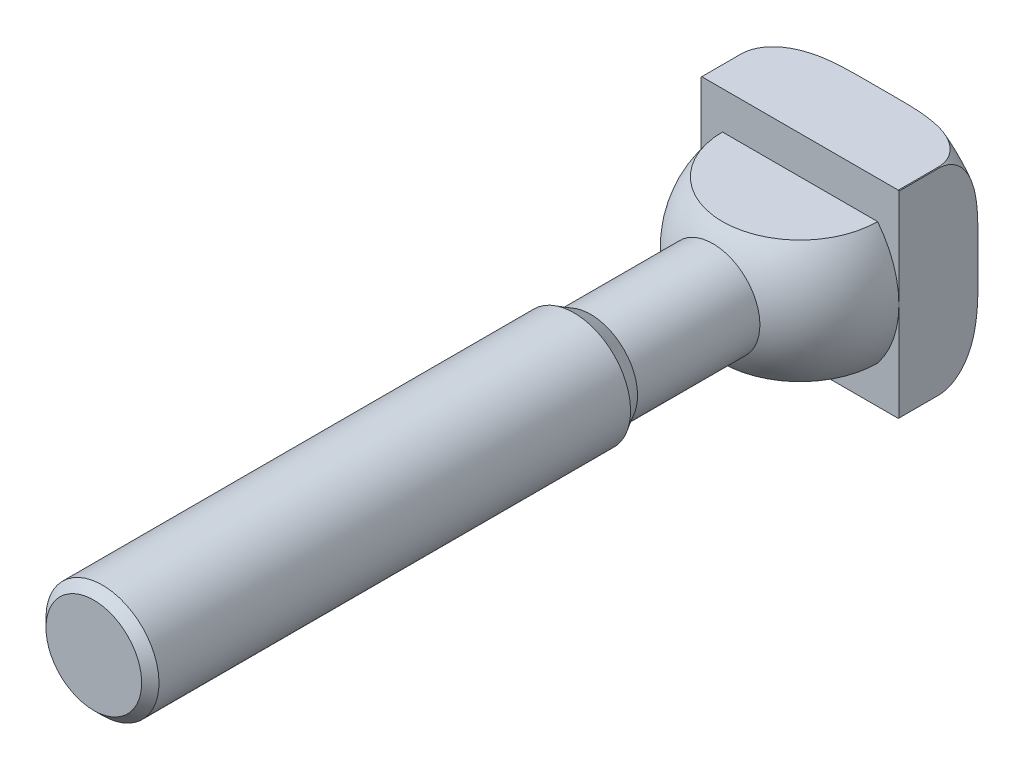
ISO-10303-21;
HEADER;
FILE_DESCRIPTION(('STEP AP214'),'2;1');
FILE_NAME('part.step','',(''),(''),'','','');
FILE_SCHEMA(('AUTOMOTIVE_DESIGN { 1 0 10303 214 1 1 1 1 }'));
ENDSEC;
DATA;
#1=APPLICATION_CONTEXT('core data for automotive mechanical design processes');
#2=APPLICATION_PROTOCOL_DEFINITION('international standard','automotive_design',2000,#1);
#3=PRODUCT_CONTEXT('',#1,'mechanical');
#4=PRODUCT('Part','Part','',(#3));
#5=PRODUCT_RELATED_PRODUCT_CATEGORY('part','',(#4));
#6=PRODUCT_DEFINITION_FORMATION('','',#4);
#7=PRODUCT_DEFINITION_CONTEXT('part definition',#1,'design');
#8=PRODUCT_DEFINITION('design','',#6,#7);
#9=PRODUCT_DEFINITION_SHAPE('','',#8);
#10=(LENGTH_UNIT() NAMED_UNIT(*) SI_UNIT(.MILLI.,.METRE.));
#11=(NAMED_UNIT(*) PLANE_ANGLE_UNIT() SI_UNIT($,.RADIAN.));
#12=(NAMED_UNIT(*) SI_UNIT($,.STERADIAN.) SOLID_ANGLE_UNIT());
#13=UNCERTAINTY_MEASURE_WITH_UNIT(LENGTH_MEASURE(1.E-05),#10,'distance_accuracy_value','');
#14=(GEOMETRIC_REPRESENTATION_CONTEXT(3) GLOBAL_UNCERTAINTY_ASSIGNED_CONTEXT((#13)) GLOBAL_UNIT_ASSIGNED_CONTEXT((#10,
#11,#12)) REPRESENTATION_CONTEXT('',''));
#15=CARTESIAN_POINT('',(0.,0.,0.));
#16=DIRECTION('',(0.,0.,1.));
#17=DIRECTION('',(1.,0.,0.));
#18=AXIS2_PLACEMENT_3D('',#15,#16,#17);
#19=CARTESIAN_POINT('',(0.,0.,-7.));
#20=DIRECTION('',(0.,0.,1.));
#21=DIRECTION('',(0.,1.,0.));
#22=AXIS2_PLACEMENT_3D('',#19,#20,#21);
#23=TOROIDAL_SURFACE('',#22,17.675,7.);
#24=CARTESIAN_POINT('',(-17.5,0.,-13.9978121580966));
#25=CARTESIAN_POINT('',(-17.5,-0.388449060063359,-13.9978135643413));
#26=CARTESIAN_POINT('',(-17.5,-0.776898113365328,-13.9981723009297));
#27=CARTESIAN_POINT('',(-17.5,-1.55379576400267,-13.9991757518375));
#28=CARTESIAN_POINT('',(-17.5,-1.94224436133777,-13.9998204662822));
#29=CARTESIAN_POINT('',(-17.5,-2.71944594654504,-14.0001197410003));
#30=CARTESIAN_POINT('',(-17.5,-3.10819893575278,-13.9997735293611));
#31=CARTESIAN_POINT('',(-17.5,-3.88570470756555,-13.9960499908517));
#32=CARTESIAN_POINT('',(-17.5,-4.27445748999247,-13.9926725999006));
#33=CARTESIAN_POINT('',(-17.5,-5.05178059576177,-13.9801914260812));
#34=CARTESIAN_POINT('',(-17.5,-5.44035094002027,-13.9710891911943));
#35=CARTESIAN_POINT('',(-17.5,-6.21718955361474,-13.9439137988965));
#36=CARTESIAN_POINT('',(-17.5,-6.60545783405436,-13.925840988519));
#37=CARTESIAN_POINT('',(-17.5,-7.38071641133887,-13.8770435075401));
#38=CARTESIAN_POINT('',(-17.5,-7.76770772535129,-13.8463359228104));
#39=CARTESIAN_POINT('',(-17.5,-8.54012803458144,-13.7681554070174));
#40=CARTESIAN_POINT('',(-17.5,-8.92555672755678,-13.7206793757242));
#41=CARTESIAN_POINT('',(-17.5,-9.7004715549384,-13.60339673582));
#42=CARTESIAN_POINT('',(-17.5,-10.0898988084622,-13.5331891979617));
#43=CARTESIAN_POINT('',(-17.5,-10.862789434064,-13.3656834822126));
#44=CARTESIAN_POINT('',(-17.5,-11.2462560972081,-13.2684008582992));
#45=CARTESIAN_POINT('',(-17.5,-12.0018639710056,-13.0419072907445));
#46=CARTESIAN_POINT('',(-17.5,-12.3740499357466,-12.9128485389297));
#47=CARTESIAN_POINT('',(-17.5,-13.1030630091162,-12.6173528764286));
#48=CARTESIAN_POINT('',(-17.5,-13.4599078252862,-12.4509605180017));
#49=CARTESIAN_POINT('',(-17.5,-14.1420716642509,-12.0805223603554));
#50=CARTESIAN_POINT('',(-17.5,-14.4679611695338,-11.8775401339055));
#51=CARTESIAN_POINT('',(-17.5,-15.0887495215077,-11.4272204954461));
#52=CARTESIAN_POINT('',(-17.5,-15.3836232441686,-11.1798475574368));
#53=CARTESIAN_POINT('',(-17.5,-15.7939764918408,-10.7735991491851));
#54=CARTESIAN_POINT('',(-17.5,-15.9261224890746,-10.631366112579));
#55=CARTESIAN_POINT('',(-17.5,-16.1771074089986,-10.3356481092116));
#56=CARTESIAN_POINT('',(-17.5,-16.2959534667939,-10.182169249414));
#57=CARTESIAN_POINT('',(-17.5,-16.5182174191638,-9.86471839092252));
#58=CARTESIAN_POINT('',(-17.5,-16.621657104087,-9.7007616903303));
#59=CARTESIAN_POINT('',(-17.5,-16.8112745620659,-9.36316201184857));
#60=CARTESIAN_POINT('',(-17.5,-16.8974588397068,-9.18952271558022));
#61=CARTESIAN_POINT('',(-17.5,-17.0306833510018,-8.88040626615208));
#62=CARTESIAN_POINT('',(-17.5,-17.0820701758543,-8.74678868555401));
#63=CARTESIAN_POINT('',(-17.5,-17.1737078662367,-8.47579588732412));
#64=CARTESIAN_POINT('',(-17.5,-17.2139608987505,-8.33842140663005));
#65=CARTESIAN_POINT('',(-17.5,-17.2827502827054,-8.06081624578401));
#66=CARTESIAN_POINT('',(-17.5,-17.3112907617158,-7.92058659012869));
#67=CARTESIAN_POINT('',(-17.5,-17.3562505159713,-7.63818623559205));
#68=CARTESIAN_POINT('',(-17.5,-17.3726693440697,-7.49601546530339));
#69=CARTESIAN_POINT('',(-17.5,-17.3931454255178,-7.2105534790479));
#70=CARTESIAN_POINT('',(-17.5,-17.397182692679,-7.06726082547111));
#71=CARTESIAN_POINT('',(-17.5,-17.3927747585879,-6.7808164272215));
#72=CARTESIAN_POINT('',(-17.5,-17.384325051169,-6.63766475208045));
#73=CARTESIAN_POINT('',(-17.5,-17.3550717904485,-6.35267251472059));
#74=CARTESIAN_POINT('',(-17.5,-17.3342716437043,-6.21083160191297));
#75=CARTESIAN_POINT('',(-17.5,-17.2806315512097,-5.92939609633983));
#76=CARTESIAN_POINT('',(-17.5,-17.2477870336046,-5.7898023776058));
#77=CARTESIAN_POINT('',(-17.5,-17.1714713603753,-5.51717596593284));
#78=CARTESIAN_POINT('',(-17.5,-17.1282750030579,-5.38406622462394));
#79=CARTESIAN_POINT('',(-17.5,-17.031454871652,-5.12167690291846));
#80=CARTESIAN_POINT('',(-17.5,-16.9778274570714,-4.99239867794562));
#81=CARTESIAN_POINT('',(-17.5,-16.8023047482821,-4.61143348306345));
#82=CARTESIAN_POINT('',(-17.5,-16.6657030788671,-4.36638565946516));
#83=CARTESIAN_POINT('',(-17.5,-16.3450249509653,-3.87627597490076));
#84=CARTESIAN_POINT('',(-17.5,-16.1576961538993,-3.63337111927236));
#85=CARTESIAN_POINT('',(-17.5,-15.7511437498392,-3.17579814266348));
#86=CARTESIAN_POINT('',(-17.5,-15.5318923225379,-2.96115496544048));
#87=CARTESIAN_POINT('',(-17.5,-15.1166648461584,-2.60199856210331));
#88=CARTESIAN_POINT('',(-17.5,-14.925227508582,-2.45215518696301));
#89=CARTESIAN_POINT('',(-17.5,-14.5298270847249,-2.16994195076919));
#90=CARTESIAN_POINT('',(-17.5,-14.3258580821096,-2.03758043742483));
#91=CARTESIAN_POINT('',(-17.5,-13.6988818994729,-1.6653897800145));
#92=CARTESIAN_POINT('',(-17.5,-13.2609105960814,-1.45054196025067));
#93=CARTESIAN_POINT('',(-17.5,-12.4409472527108,-1.11157031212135));
#94=CARTESIAN_POINT('',(-17.5,-12.0626184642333,-0.97814210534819));
#95=CARTESIAN_POINT('',(-17.5,-11.2955303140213,-0.744772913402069));
#96=CARTESIAN_POINT('',(-17.5,-10.9067630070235,-0.644858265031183));
#97=CARTESIAN_POINT('',(-17.5,-10.121671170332,-0.47277573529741));
#98=CARTESIAN_POINT('',(-17.5,-9.72532251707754,-0.400721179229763));
#99=CARTESIAN_POINT('',(-17.5,-8.92940755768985,-0.27956258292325));
#100=CARTESIAN_POINT('',(-17.5,-8.52984271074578,-0.230448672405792));
#101=CARTESIAN_POINT('',(-17.5,-7.60752790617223,-0.137940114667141));
#102=CARTESIAN_POINT('',(-17.5,-7.08417339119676,-0.100798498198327));
#103=CARTESIAN_POINT('',(-17.5,-6.03635725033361,-0.0469308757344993));
#104=CARTESIAN_POINT('',(-17.5,-5.51189527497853,-0.0302127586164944));
#105=CARTESIAN_POINT('',(-17.5,-4.72472261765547,-0.0140997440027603));
#106=CARTESIAN_POINT('',(-17.5,-4.46208166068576,-0.010223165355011));
#107=CARTESIAN_POINT('',(-17.5,-3.93677626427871,-0.00457927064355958));
#108=CARTESIAN_POINT('',(-17.5,-3.67411182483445,-0.00281195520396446));
#109=CARTESIAN_POINT('',(-17.5,-3.14882284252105,-0.000594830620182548));
#110=CARTESIAN_POINT('',(-17.5,-2.88619830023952,-0.000144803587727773));
#111=CARTESIAN_POINT('',(-17.5,-2.36094969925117,8.43665232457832E-05));
#112=CARTESIAN_POINT('',(-17.5,-2.09832564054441,-0.000136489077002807));
#113=CARTESIAN_POINT('',(-17.5,-1.57325334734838,-0.000754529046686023));
#114=CARTESIAN_POINT('',(-17.5,-1.3108051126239,-0.00115159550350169));
#115=CARTESIAN_POINT('',(-17.5,-0.785908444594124,-0.00179565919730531));
#116=CARTESIAN_POINT('',(-17.5,-0.523460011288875,-0.00204265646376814));
#117=CARTESIAN_POINT('',(-17.5,0.00144887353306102,-0.00223622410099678));
#118=CARTESIAN_POINT('',(-17.5,0.263909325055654,-0.00218278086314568));
#119=CARTESIAN_POINT('',(-17.5,0.788829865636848,-0.00180601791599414));
#120=CARTESIAN_POINT('',(-17.5,1.05128995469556,-0.00148269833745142));
#121=CARTESIAN_POINT('',(-17.5,1.57605180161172,-0.000776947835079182));
#122=CARTESIAN_POINT('',(-17.5,1.83835355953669,-0.000394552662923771));
#123=CARTESIAN_POINT('',(-17.5,2.36295729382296,4.63168922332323E-05));
#124=CARTESIAN_POINT('',(-17.5,2.62525927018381,0.00010479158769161));
#125=CARTESIAN_POINT('',(-17.5,3.149853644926,-0.000647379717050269));
#126=CARTESIAN_POINT('',(-17.5,3.4121460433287,-0.00145799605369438));
#127=CARTESIAN_POINT('',(-17.5,3.93672069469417,-0.00464072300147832));
#128=CARTESIAN_POINT('',(-17.5,4.1990029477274,-0.00701281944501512));
#129=CARTESIAN_POINT('',(-17.5,4.65230158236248,-0.013176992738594));
#130=CARTESIAN_POINT('',(-17.5,4.84332513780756,-0.0164083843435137));
#131=CARTESIAN_POINT('',(-17.5,5.22533824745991,-0.0245003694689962));
#132=CARTESIAN_POINT('',(-17.5,5.41632780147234,-0.0293609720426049));
#133=CARTESIAN_POINT('',(-17.5,5.98924358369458,-0.0469622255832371));
#134=CARTESIAN_POINT('',(-17.5,6.37108844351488,-0.0627220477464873));
#135=CARTESIAN_POINT('',(-17.5,7.13466290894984,-0.105754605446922));
#136=CARTESIAN_POINT('',(-17.5,7.51639171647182,-0.133042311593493));
#137=CARTESIAN_POINT('',(-17.5,8.27847662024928,-0.202989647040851));
#138=CARTESIAN_POINT('',(-17.5,8.65883277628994,-0.245648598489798));
#139=CARTESIAN_POINT('',(-17.5,9.42195850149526,-0.351246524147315));
#140=CARTESIAN_POINT('',(-17.5,9.80469288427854,-0.414447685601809));
#141=CARTESIAN_POINT('',(-17.5,10.5654459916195,-0.565698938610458));
#142=CARTESIAN_POINT('',(-17.5,10.943463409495,-0.653755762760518));
#143=CARTESIAN_POINT('',(-17.5,11.6902728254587,-0.859393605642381));
#144=CARTESIAN_POINT('',(-17.5,12.0590899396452,-0.97688159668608));
#145=CARTESIAN_POINT('',(-17.5,12.7836720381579,-1.24650276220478));
#146=CARTESIAN_POINT('',(-17.5,13.1394491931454,-1.39860262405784));
#147=CARTESIAN_POINT('',(-17.5,13.8415571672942,-1.74733174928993));
#148=CARTESIAN_POINT('',(-17.5,14.1873239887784,-1.94511352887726));
#149=CARTESIAN_POINT('',(-17.5,14.8485763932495,-2.38739698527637));
#150=CARTESIAN_POINT('',(-17.5,15.1640528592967,-2.63191266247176));
#151=CARTESIAN_POINT('',(-17.5,15.6057116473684,-3.03656741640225));
#152=CARTESIAN_POINT('',(-17.5,15.7484799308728,-3.17879792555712));
#153=CARTESIAN_POINT('',(-17.5,16.02058218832,-3.47553091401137));
#154=CARTESIAN_POINT('',(-17.5,16.1499236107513,-3.6300265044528));
#155=CARTESIAN_POINT('',(-17.5,16.392848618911,-3.95063608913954));
#156=CARTESIAN_POINT('',(-17.5,16.5064542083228,-4.11673336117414));
#157=CARTESIAN_POINT('',(-17.5,16.7158362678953,-4.45979707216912));
#158=CARTESIAN_POINT('',(-17.5,16.8116204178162,-4.63675878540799));
#159=CARTESIAN_POINT('',(-17.5,16.9589551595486,-4.94876888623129));
#160=CARTESIAN_POINT('',(-17.5,17.0153588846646,-5.08154294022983));
#161=CARTESIAN_POINT('',(-17.5,17.117142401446,-5.35124238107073));
#162=CARTESIAN_POINT('',(-17.5,17.1625245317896,-5.48816688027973));
#163=CARTESIAN_POINT('',(-17.5,17.2416148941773,-5.76529141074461));
#164=CARTESIAN_POINT('',(-17.5,17.2753279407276,-5.90549006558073));
#165=CARTESIAN_POINT('',(-17.5,17.3306061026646,-6.18827496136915));
#166=CARTESIAN_POINT('',(-17.5,17.3521707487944,-6.3308612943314));
#167=CARTESIAN_POINT('',(-17.5,17.3828473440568,-6.61768637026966));
#168=CARTESIAN_POINT('',(-17.5,17.3919319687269,-6.76192804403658));
#169=CARTESIAN_POINT('',(-17.5,17.3974162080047,-7.05070537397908));
#170=CARTESIAN_POINT('',(-17.5,17.3938112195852,-7.1952411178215));
#171=CARTESIAN_POINT('',(-17.5,17.3739668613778,-7.48339401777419));
#172=CARTESIAN_POINT('',(-17.5,17.3577315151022,-7.62701145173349));
#173=CARTESIAN_POINT('',(-17.5,17.3128806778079,-7.9123497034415));
#174=CARTESIAN_POINT('',(-17.5,17.2842605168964,-8.05406978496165));
#175=CARTESIAN_POINT('',(-17.5,17.216265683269,-8.32972580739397));
#176=CARTESIAN_POINT('',(-17.5,17.1772954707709,-8.46376171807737));
#177=CARTESIAN_POINT('',(-17.5,17.0887514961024,-8.72830148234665));
#178=CARTESIAN_POINT('',(-17.5,17.0391740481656,-8.85880409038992));
#179=CARTESIAN_POINT('',(-17.5,16.8754700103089,-9.2438384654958));
#180=CARTESIAN_POINT('',(-17.5,16.7463149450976,-9.49212171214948));
#181=CARTESIAN_POINT('',(-17.5,16.4418120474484,-9.98701450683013));
#182=CARTESIAN_POINT('',(-17.5,16.2635309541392,-10.2317936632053));
#183=CARTESIAN_POINT('',(-17.5,15.8745026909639,-10.6940423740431));
#184=CARTESIAN_POINT('',(-17.5,15.6637350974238,-10.911494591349));
#185=CARTESIAN_POINT('',(-17.5,15.2660576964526,-11.2735884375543));
#186=CARTESIAN_POINT('',(-17.5,15.0840775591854,-11.4237312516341));
#187=CARTESIAN_POINT('',(-17.5,14.7075403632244,-11.7073892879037));
#188=CARTESIAN_POINT('',(-17.5,14.5129776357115,-11.8408969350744));
#189=CARTESIAN_POINT('',(-17.5,13.9137092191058,-12.2177425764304));
#190=CARTESIAN_POINT('',(-17.5,13.4937742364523,-12.4370952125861));
#191=CARTESIAN_POINT('',(-17.5,12.7133171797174,-12.7823631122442));
#192=CARTESIAN_POINT('',(-17.5,12.3569593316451,-12.9181401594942));
#193=CARTESIAN_POINT('',(-17.5,11.6335174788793,-13.1580292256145));
#194=CARTESIAN_POINT('',(-17.5,11.2664258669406,-13.2621181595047));
#195=CARTESIAN_POINT('',(-17.5,10.5251422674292,-13.443446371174));
#196=CARTESIAN_POINT('',(-17.5,10.1509388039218,-13.5206375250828));
#197=CARTESIAN_POINT('',(-17.5,9.39854189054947,-13.6526484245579));
#198=CARTESIAN_POINT('',(-17.5,9.0203469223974,-13.7074593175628));
#199=CARTESIAN_POINT('',(-17.5,8.28352844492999,-13.7964449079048));
#200=CARTESIAN_POINT('',(-17.5,7.92502154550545,-13.8316198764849));
#201=CARTESIAN_POINT('',(-17.5,7.20708250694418,-13.8893676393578));
#202=CARTESIAN_POINT('',(-17.5,6.84765051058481,-13.911942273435));
#203=CARTESIAN_POINT('',(-17.5,6.12802310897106,-13.9476437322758));
#204=CARTESIAN_POINT('',(-17.5,5.76782730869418,-13.9607621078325));
#205=CARTESIAN_POINT('',(-17.5,5.04725920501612,-13.9803383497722));
#206=CARTESIAN_POINT('',(-17.5,4.68688689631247,-13.9867960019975));
#207=CARTESIAN_POINT('',(-17.5,3.96586036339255,-13.9955068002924));
#208=CARTESIAN_POINT('',(-17.5,3.60520611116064,-13.9977571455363));
#209=CARTESIAN_POINT('',(-17.5,2.88389986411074,-14.0000731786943));
#210=CARTESIAN_POINT('',(-17.5,2.52324786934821,-14.0001389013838));
#211=CARTESIAN_POINT('',(-17.5,1.8021635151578,-13.9996106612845));
#212=CARTESIAN_POINT('',(-17.5,1.44173115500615,-13.9990170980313));
#213=CARTESIAN_POINT('',(-17.5,0.720865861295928,-13.9981171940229));
#214=CARTESIAN_POINT('',(-17.5,0.360432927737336,-13.9978108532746));
#215=CARTESIAN_POINT('',(-17.5,0.,-13.9978121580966));
#216=B_SPLINE_CURVE_WITH_KNOTS('',3,(#24,#25,#26,#27,#28,#29,#30,#31,#32,#33,#34,#35,#36,#37,
#38,#39,#40,#41,#42,#43,#44,#45,#46,#47,#48,#49,#50,#51,#52,#53,#54,#55,#56,#57,#58,#59,#60,#61,
#62,#63,#64,#65,#66,#67,#68,#69,#70,#71,#72,#73,#74,#75,#76,#77,#78,#79,#80,#81,#82,#83,#84,#85,
#86,#87,#88,#89,#90,#91,#92,#93,#94,#95,#96,#97,#98,#99,#100,#101,#102,#103,#104,#105,#106,#107,
#108,#109,#110,#111,#112,#113,#114,#115,#116,#117,#118,#119,#120,#121,#122,#123,#124,#125,#126,
#127,#128,#129,#130,#131,#132,#133,#134,#135,#136,#137,#138,#139,#140,#141,#142,#143,#144,#145,
#146,#147,#148,#149,#150,#151,#152,#153,#154,#155,#156,#157,#158,#159,#160,#161,#162,#163,#164,
#165,#166,#167,#168,#169,#170,#171,#172,#173,#174,#175,#176,#177,#178,#179,#180,#181,#182,#183,
#184,#185,#186,#187,#188,#189,#190,#191,#192,#193,#194,#195,#196,#197,#198,#199,#200,#201,#202,
#203,#204,#205,#206,#207,#208,#209,#210,#211,#212,#213,#214,#215),.UNSPECIFIED.,.T.,.F.,(4,2,2,
2,2,2,2,2,2,2,2,2,2,2,2,2,2,2,2,2,2,2,2,2,2,2,2,2,2,2,2,2,2,2,2,2,2,2,2,2,2,2,2,2,2,2,2,2,2,2,2,
2,2,2,2,2,2,2,2,2,2,2,2,2,2,2,2,2,2,2,2,2,2,2,2,2,2,2,2,2,2,2,2,2,2,2,2,2,2,2,2,2,2,2,2,4),(0.,
1.16534717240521,2.33069485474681,3.49695056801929,4.66323093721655,5.82919608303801,
6.99511612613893,8.15946466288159,9.32402858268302,10.5103669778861,11.6960252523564,
12.8761116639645,14.0547972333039,15.2035486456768,16.353223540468,16.9350159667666,
17.5164947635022,18.09714315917,18.6775722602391,19.1066044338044,19.5355530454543,
19.9643503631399,20.3931634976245,20.8226684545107,21.2523284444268,21.6818699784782,
22.1115747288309,22.5309369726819,22.9504458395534,23.7887527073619,24.7057344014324,
25.6235200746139,26.3518416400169,27.0805097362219,28.5382509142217,29.7401885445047,
30.943068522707,32.150791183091,33.3579937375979,34.9313525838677,36.5053189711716,
37.2933227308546,38.0813267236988,38.8692003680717,39.6570724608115,40.4444181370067,
41.2317636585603,42.019144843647,42.8065256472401,43.5934317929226,44.3803371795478,
45.1672157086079,45.9540870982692,46.5272334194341,47.1003829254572,48.2467673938,
49.3946452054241,50.5424724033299,51.7055662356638,52.8689754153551,54.028752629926,
55.1874182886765,56.3793313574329,57.5716020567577,58.1754983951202,58.7790579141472,
59.3817647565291,59.9842112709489,60.4165476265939,60.8487921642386,61.280858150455,
61.7129408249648,62.1459680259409,62.5791523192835,63.0121986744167,63.4454084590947,
63.8636941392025,64.282125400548,65.1182997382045,66.0235061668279,66.9292840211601,
67.6360904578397,68.3432175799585,69.7588553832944,70.9014301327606,72.0448352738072,
73.1902757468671,74.3361688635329,75.4165796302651,76.4968326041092,77.5780495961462,
78.6593013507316,79.741272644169,80.8232267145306,81.9045254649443,82.9858242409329),.UNSPECIFIED.);
#217=CARTESIAN_POINT('',(-17.5,-2.48105320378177,-14.));
#218=VERTEX_POINT('',#217);
#219=CARTESIAN_POINT('',(-17.5,-17.3955633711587,-7.));
#220=VERTEX_POINT('',#219);
#221=EDGE_CURVE('E140',#218,#220,#216,.T.);
#222=ORIENTED_EDGE('',*,*,#221,.F.);
#223=CARTESIAN_POINT('',(0.,0.,-14.));
#224=DIRECTION('',(0.,0.,1.));
#225=DIRECTION('',(0.,1.,0.));
#226=AXIS2_PLACEMENT_3D('',#223,#224,#225);
#227=CIRCLE('',#226,17.675);
#228=CARTESIAN_POINT('',(-2.48105320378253,-17.5,-14.));
#229=VERTEX_POINT('',#228);
#230=EDGE_CURVE('E239',#218,#229,#227,.T.);
#231=ORIENTED_EDGE('',*,*,#230,.T.);
#232=CARTESIAN_POINT('',(0.,-17.5,-13.9978121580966));
#233=CARTESIAN_POINT('',(0.388449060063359,-17.5,-13.9978135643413));
#234=CARTESIAN_POINT('',(0.776898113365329,-17.5,-13.9981723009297));
#235=CARTESIAN_POINT('',(1.55379576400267,-17.5,-13.9991757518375));
#236=CARTESIAN_POINT('',(1.94224436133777,-17.5,-13.9998204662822));
#237=CARTESIAN_POINT('',(2.71944594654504,-17.5,-14.0001197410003));
#238=CARTESIAN_POINT('',(3.10819893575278,-17.5,-13.9997735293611));
#239=CARTESIAN_POINT('',(3.88570470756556,-17.5,-13.9960499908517));
#240=CARTESIAN_POINT('',(4.27445748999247,-17.5,-13.9926725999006));
#241=CARTESIAN_POINT('',(5.05178059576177,-17.5,-13.9801914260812));
#242=CARTESIAN_POINT('',(5.44035094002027,-17.5,-13.9710891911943));
#243=CARTESIAN_POINT('',(6.21718955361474,-17.5,-13.9439137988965));
#244=CARTESIAN_POINT('',(6.60545783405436,-17.5,-13.925840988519));
#245=CARTESIAN_POINT('',(7.38071641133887,-17.5,-13.8770435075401));
#246=CARTESIAN_POINT('',(7.76770772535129,-17.5,-13.8463359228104));
#247=CARTESIAN_POINT('',(8.54012803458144,-17.5,-13.7681554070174));
#248=CARTESIAN_POINT('',(8.92555672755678,-17.5,-13.7206793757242));
#249=CARTESIAN_POINT('',(9.70047155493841,-17.5,-13.60339673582));
#250=CARTESIAN_POINT('',(10.0898988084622,-17.5,-13.5331891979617));
#251=CARTESIAN_POINT('',(10.862789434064,-17.5,-13.3656834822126));
#252=CARTESIAN_POINT('',(11.2462560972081,-17.5,-13.2684008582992));
#253=CARTESIAN_POINT('',(12.0018639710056,-17.5,-13.0419072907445));
#254=CARTESIAN_POINT('',(12.3740499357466,-17.5,-12.9128485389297));
#255=CARTESIAN_POINT('',(13.1030630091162,-17.5,-12.6173528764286));
#256=CARTESIAN_POINT('',(13.4599078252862,-17.5,-12.4509605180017));
#257=CARTESIAN_POINT('',(14.1420716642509,-17.5,-12.0805223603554));
#258=CARTESIAN_POINT('',(14.4679611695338,-17.5,-11.8775401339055));
#259=CARTESIAN_POINT('',(15.0887495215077,-17.5,-11.4272204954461));
#260=CARTESIAN_POINT('',(15.3836232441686,-17.5,-11.1798475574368));
#261=CARTESIAN_POINT('',(15.7939764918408,-17.5,-10.7735991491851));
#262=CARTESIAN_POINT('',(15.9261224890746,-17.5,-10.631366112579));
#263=CARTESIAN_POINT('',(16.1771074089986,-17.5,-10.3356481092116));
#264=CARTESIAN_POINT('',(16.2959534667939,-17.5,-10.182169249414));
#265=CARTESIAN_POINT('',(16.5182174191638,-17.5,-9.86471839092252));
#266=CARTESIAN_POINT('',(16.621657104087,-17.5,-9.7007616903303));
#267=CARTESIAN_POINT('',(16.8112745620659,-17.5,-9.36316201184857));
#268=CARTESIAN_POINT('',(16.8974588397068,-17.5,-9.18952271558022));
#269=CARTESIAN_POINT('',(17.0306833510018,-17.5,-8.88040626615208));
#270=CARTESIAN_POINT('',(17.0820701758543,-17.5,-8.74678868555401));
#271=CARTESIAN_POINT('',(17.1737078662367,-17.5,-8.47579588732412));
#272=CARTESIAN_POINT('',(17.2139608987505,-17.5,-8.33842140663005));
#273=CARTESIAN_POINT('',(17.2827502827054,-17.5,-8.06081624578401));
#274=CARTESIAN_POINT('',(17.3112907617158,-17.5,-7.92058659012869));
#275=CARTESIAN_POINT('',(17.3562505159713,-17.5,-7.63818623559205));
#276=CARTESIAN_POINT('',(17.3726693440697,-17.5,-7.4960154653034));
#277=CARTESIAN_POINT('',(17.3931454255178,-17.5,-7.2105534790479));
#278=CARTESIAN_POINT('',(17.397182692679,-17.5,-7.06726082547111));
#279=CARTESIAN_POINT('',(17.3927747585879,-17.5,-6.78081642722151));
#280=CARTESIAN_POINT('',(17.384325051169,-17.5,-6.63766475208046));
#281=CARTESIAN_POINT('',(17.3550717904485,-17.5,-6.35267251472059));
#282=CARTESIAN_POINT('',(17.3342716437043,-17.5,-6.21083160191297));
#283=CARTESIAN_POINT('',(17.2806315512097,-17.5,-5.92939609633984));
#284=CARTESIAN_POINT('',(17.2477870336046,-17.5,-5.78980237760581));
#285=CARTESIAN_POINT('',(17.1714713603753,-17.5,-5.51717596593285));
#286=CARTESIAN_POINT('',(17.1282750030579,-17.5,-5.38406622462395));
#287=CARTESIAN_POINT('',(17.031454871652,-17.5,-5.12167690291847));
#288=CARTESIAN_POINT('',(16.9778274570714,-17.5,-4.99239867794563));
#289=CARTESIAN_POINT('',(16.8023047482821,-17.5,-4.61143348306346));
#290=CARTESIAN_POINT('',(16.6657030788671,-17.5,-4.36638565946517));
#291=CARTESIAN_POINT('',(16.3450249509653,-17.5,-3.87627597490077));
#292=CARTESIAN_POINT('',(16.1576961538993,-17.5,-3.63337111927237));
#293=CARTESIAN_POINT('',(15.7511437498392,-17.5,-3.17579814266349));
#294=CARTESIAN_POINT('',(15.5318923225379,-17.5,-2.96115496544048));
#295=CARTESIAN_POINT('',(15.1166648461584,-17.5,-2.60199856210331));
#296=CARTESIAN_POINT('',(14.925227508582,-17.5,-2.45215518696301));
#297=CARTESIAN_POINT('',(14.5298270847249,-17.5,-2.1699419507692));
#298=CARTESIAN_POINT('',(14.3258580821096,-17.5,-2.03758043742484));
#299=CARTESIAN_POINT('',(13.6988818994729,-17.5,-1.66538978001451));
#300=CARTESIAN_POINT('',(13.2609105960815,-17.5,-1.45054196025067));
#301=CARTESIAN_POINT('',(12.4409472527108,-17.5,-1.11157031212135));
#302=CARTESIAN_POINT('',(12.0626184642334,-17.5,-0.978142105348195));
#303=CARTESIAN_POINT('',(11.2955303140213,-17.5,-0.744772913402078));
#304=CARTESIAN_POINT('',(10.9067630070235,-17.5,-0.64485826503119));
#305=CARTESIAN_POINT('',(10.121671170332,-17.5,-0.472775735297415));
#306=CARTESIAN_POINT('',(9.72532251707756,-17.5,-0.400721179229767));
#307=CARTESIAN_POINT('',(8.92940755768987,-17.5,-0.279562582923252));
#308=CARTESIAN_POINT('',(8.5298427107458,-17.5,-0.230448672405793));
#309=CARTESIAN_POINT('',(7.60752790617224,-17.5,-0.13794011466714));
#310=CARTESIAN_POINT('',(7.08417339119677,-17.5,-0.100798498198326));
#311=CARTESIAN_POINT('',(6.03635725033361,-17.5,-0.0469308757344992));
#312=CARTESIAN_POINT('',(5.51189527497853,-17.5,-0.0302127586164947));
#313=CARTESIAN_POINT('',(4.72472261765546,-17.5,-0.0140997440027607));
#314=CARTESIAN_POINT('',(4.46208166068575,-17.5,-0.0102231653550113));
#315=CARTESIAN_POINT('',(3.9367762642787,-17.5,-0.00457927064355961));
#316=CARTESIAN_POINT('',(3.67411182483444,-17.5,-0.00281195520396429));
#317=CARTESIAN_POINT('',(3.14882284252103,-17.5,-0.000594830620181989));
#318=CARTESIAN_POINT('',(2.88619830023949,-17.5,-0.000144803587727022));
#319=CARTESIAN_POINT('',(2.36094969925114,-17.5,8.43665232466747E-05));
#320=CARTESIAN_POINT('',(2.09832564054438,-17.5,-0.000136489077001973));
#321=CARTESIAN_POINT('',(1.57325334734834,-17.5,-0.000754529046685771));
#322=CARTESIAN_POINT('',(1.31080511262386,-17.5,-0.00115159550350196));
#323=CARTESIAN_POINT('',(0.785908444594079,-17.5,-0.00179565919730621));
#324=CARTESIAN_POINT('',(0.52346001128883,-17.5,-0.00204265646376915));
#325=CARTESIAN_POINT('',(-0.00144887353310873,-17.5,-0.002236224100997));
#326=CARTESIAN_POINT('',(-0.263909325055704,-17.5,-0.00218278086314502));
#327=CARTESIAN_POINT('',(-0.788829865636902,-17.5,-0.00180601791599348));
#328=CARTESIAN_POINT('',(-1.05128995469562,-17.5,-0.00148269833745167));
#329=CARTESIAN_POINT('',(-1.57605180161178,-17.5,-0.000776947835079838));
#330=CARTESIAN_POINT('',(-1.83835355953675,-17.5,-0.000394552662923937));
#331=CARTESIAN_POINT('',(-2.36295729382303,-17.5,4.63168922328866E-05));
#332=CARTESIAN_POINT('',(-2.62525927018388,-17.5,0.000104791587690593));
#333=CARTESIAN_POINT('',(-3.14985364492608,-17.5,-0.000647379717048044));
#334=CARTESIAN_POINT('',(-3.41214604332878,-17.5,-0.00145799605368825));
#335=CARTESIAN_POINT('',(-3.93672069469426,-17.5,-0.00464072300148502));
#336=CARTESIAN_POINT('',(-4.19900294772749,-17.5,-0.00701281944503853));
#337=CARTESIAN_POINT('',(-4.65230158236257,-17.5,-0.0131769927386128));
#338=CARTESIAN_POINT('',(-4.84332513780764,-17.5,-0.0164083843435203));
#339=CARTESIAN_POINT('',(-5.22533824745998,-17.5,-0.0245003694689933));
#340=CARTESIAN_POINT('',(-5.41632780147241,-17.5,-0.0293609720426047));
#341=CARTESIAN_POINT('',(-5.98924358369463,-17.5,-0.0469622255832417));
#342=CARTESIAN_POINT('',(-6.37108844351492,-17.5,-0.0627220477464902));
#343=CARTESIAN_POINT('',(-7.13466290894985,-17.5,-0.105754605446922));
#344=CARTESIAN_POINT('',(-7.51639171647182,-17.5,-0.133042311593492));
#345=CARTESIAN_POINT('',(-8.27847662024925,-17.5,-0.20298964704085));
#346=CARTESIAN_POINT('',(-8.65883277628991,-17.5,-0.2456485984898));
#347=CARTESIAN_POINT('',(-9.4219585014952,-17.5,-0.351246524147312));
#348=CARTESIAN_POINT('',(-9.80469288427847,-17.5,-0.414447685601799));
#349=CARTESIAN_POINT('',(-10.5654459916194,-17.5,-0.565698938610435));
#350=CARTESIAN_POINT('',(-10.9434634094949,-17.5,-0.653755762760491));
#351=CARTESIAN_POINT('',(-11.6902728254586,-17.5,-0.859393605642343));
#352=CARTESIAN_POINT('',(-12.059089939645,-17.5,-0.976881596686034));
#353=CARTESIAN_POINT('',(-12.7836720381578,-17.5,-1.24650276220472));
#354=CARTESIAN_POINT('',(-13.1394491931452,-17.5,-1.39860262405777));
#355=CARTESIAN_POINT('',(-13.8415571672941,-17.5,-1.74733174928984));
#356=CARTESIAN_POINT('',(-14.1873239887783,-17.5,-1.94511352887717));
#357=CARTESIAN_POINT('',(-14.8485763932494,-17.5,-2.38739698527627));
#358=CARTESIAN_POINT('',(-15.1640528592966,-17.5,-2.63191266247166));
#359=CARTESIAN_POINT('',(-15.6057116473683,-17.5,-3.03656741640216));
#360=CARTESIAN_POINT('',(-15.7484799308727,-17.5,-3.17879792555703));
#361=CARTESIAN_POINT('',(-16.0205821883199,-17.5,-3.47553091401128));
#362=CARTESIAN_POINT('',(-16.1499236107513,-17.5,-3.63002650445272));
#363=CARTESIAN_POINT('',(-16.392848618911,-17.5,-3.95063608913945));
#364=CARTESIAN_POINT('',(-16.5064542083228,-17.5,-4.11673336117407));
#365=CARTESIAN_POINT('',(-16.7158362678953,-17.5,-4.45979707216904));
#366=CARTESIAN_POINT('',(-16.8116204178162,-17.5,-4.6367587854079));
#367=CARTESIAN_POINT('',(-16.9589551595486,-17.5,-4.9487688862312));
#368=CARTESIAN_POINT('',(-17.0153588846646,-17.5,-5.08154294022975));
#369=CARTESIAN_POINT('',(-17.117142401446,-17.5,-5.35124238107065));
#370=CARTESIAN_POINT('',(-17.1625245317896,-17.5,-5.48816688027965));
#371=CARTESIAN_POINT('',(-17.2416148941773,-17.5,-5.76529141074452));
#372=CARTESIAN_POINT('',(-17.2753279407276,-17.5,-5.90549006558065));
#373=CARTESIAN_POINT('',(-17.3306061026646,-17.5,-6.18827496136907));
#374=CARTESIAN_POINT('',(-17.3521707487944,-17.5,-6.33086129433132));
#375=CARTESIAN_POINT('',(-17.3828473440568,-17.5,-6.61768637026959));
#376=CARTESIAN_POINT('',(-17.3919319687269,-17.5,-6.76192804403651));
#377=CARTESIAN_POINT('',(-17.3974162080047,-17.5,-7.050705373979));
#378=CARTESIAN_POINT('',(-17.3938112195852,-17.5,-7.19524111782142));
#379=CARTESIAN_POINT('',(-17.3739668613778,-17.5,-7.48339401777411));
#380=CARTESIAN_POINT('',(-17.3577315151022,-17.5,-7.62701145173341));
#381=CARTESIAN_POINT('',(-17.3128806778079,-17.5,-7.91234970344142));
#382=CARTESIAN_POINT('',(-17.2842605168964,-17.5,-8.05406978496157));
#383=CARTESIAN_POINT('',(-17.2162656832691,-17.5,-8.32972580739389));
#384=CARTESIAN_POINT('',(-17.1772954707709,-17.5,-8.4637617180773));
#385=CARTESIAN_POINT('',(-17.0887514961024,-17.5,-8.72830148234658));
#386=CARTESIAN_POINT('',(-17.0391740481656,-17.5,-8.85880409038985));
#387=CARTESIAN_POINT('',(-16.875470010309,-17.5,-9.24383846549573));
#388=CARTESIAN_POINT('',(-16.7463149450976,-17.5,-9.49212171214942));
#389=CARTESIAN_POINT('',(-16.4418120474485,-17.5,-9.98701450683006));
#390=CARTESIAN_POINT('',(-16.2635309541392,-17.5,-10.2317936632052));
#391=CARTESIAN_POINT('',(-15.8745026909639,-17.5,-10.694042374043));
#392=CARTESIAN_POINT('',(-15.6637350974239,-17.5,-10.9114945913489));
#393=CARTESIAN_POINT('',(-15.2660576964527,-17.5,-11.2735884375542));
#394=CARTESIAN_POINT('',(-15.0840775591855,-17.5,-11.423731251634));
#395=CARTESIAN_POINT('',(-14.7075403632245,-17.5,-11.7073892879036));
#396=CARTESIAN_POINT('',(-14.5129776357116,-17.5,-11.8408969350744));
#397=CARTESIAN_POINT('',(-13.9137092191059,-17.5,-12.2177425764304));
#398=CARTESIAN_POINT('',(-13.4937742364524,-17.5,-12.437095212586));
#399=CARTESIAN_POINT('',(-12.7133171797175,-17.5,-12.7823631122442));
#400=CARTESIAN_POINT('',(-12.3569593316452,-17.5,-12.9181401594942));
#401=CARTESIAN_POINT('',(-11.6335174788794,-17.5,-13.1580292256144));
#402=CARTESIAN_POINT('',(-11.2664258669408,-17.5,-13.2621181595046));
#403=CARTESIAN_POINT('',(-10.5251422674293,-17.5,-13.4434463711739));
#404=CARTESIAN_POINT('',(-10.1509388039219,-17.5,-13.5206375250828));
#405=CARTESIAN_POINT('',(-9.39854189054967,-17.5,-13.6526484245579));
#406=CARTESIAN_POINT('',(-9.02034692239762,-17.5,-13.7074593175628));
#407=CARTESIAN_POINT('',(-8.28352844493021,-17.5,-13.7964449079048));
#408=CARTESIAN_POINT('',(-7.92502154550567,-17.5,-13.8316198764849));
#409=CARTESIAN_POINT('',(-7.20708250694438,-17.5,-13.8893676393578));
#410=CARTESIAN_POINT('',(-6.847650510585,-17.5,-13.911942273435));
#411=CARTESIAN_POINT('',(-6.12802310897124,-17.5,-13.9476437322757));
#412=CARTESIAN_POINT('',(-5.76782730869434,-17.5,-13.9607621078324));
#413=CARTESIAN_POINT('',(-5.04725920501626,-17.5,-13.9803383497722));
#414=CARTESIAN_POINT('',(-4.68688689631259,-17.5,-13.9867960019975));
#415=CARTESIAN_POINT('',(-3.96586036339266,-17.5,-13.9955068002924));
#416=CARTESIAN_POINT('',(-3.60520611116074,-17.5,-13.9977571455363));
#417=CARTESIAN_POINT('',(-2.88389986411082,-17.5,-14.0000731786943));
#418=CARTESIAN_POINT('',(-2.52324786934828,-17.5,-14.0001389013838));
#419=CARTESIAN_POINT('',(-1.80216351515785,-17.5,-13.9996106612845));
#420=CARTESIAN_POINT('',(-1.44173115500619,-17.5,-13.9990170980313));
#421=CARTESIAN_POINT('',(-0.720865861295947,-17.5,-13.9981171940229));
#422=CARTESIAN_POINT('',(-0.360432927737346,-17.5,-13.9978108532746));
#423=CARTESIAN_POINT('',(0.,-17.5,-13.9978121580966));
#424=B_SPLINE_CURVE_WITH_KNOTS('',3,(#232,#233,#234,#235,#236,#237,#238,#239,#240,#241,#242,
#243,#244,#245,#246,#247,#248,#249,#250,#251,#252,#253,#254,#255,#256,#257,#258,#259,#260,#261,
#262,#263,#264,#265,#266,#267,#268,#269,#270,#271,#272,#273,#274,#275,#276,#277,#278,#279,#280,
#281,#282,#283,#284,#285,#286,#287,#288,#289,#290,#291,#292,#293,#294,#295,#296,#297,#298,#299,
#300,#301,#302,#303,#304,#305,#306,#307,#308,#309,#310,#311,#312,#313,#314,#315,#316,#317,#318,
#319,#320,#321,#322,#323,#324,#325,#326,#327,#328,#329,#330,#331,#332,#333,#334,#335,#336,#337,
#338,#339,#340,#341,#342,#343,#344,#345,#346,#347,#348,#349,#350,#351,#352,#353,#354,#355,#356,
#357,#358,#359,#360,#361,#362,#363,#364,#365,#366,#367,#368,#369,#370,#371,#372,#373,#374,#375,
#376,#377,#378,#379,#380,#381,#382,#383,#384,#385,#386,#387,#388,#389,#390,#391,#392,#393,#394,
#395,#396,#397,#398,#399,#400,#401,#402,#403,#404,#405,#406,#407,#408,#409,#410,#411,#412,#413,
#414,#415,#416,#417,#418,#419,#420,#421,#422,#423),.UNSPECIFIED.,.T.,.F.,(4,2,2,2,2,2,2,2,2,2,2,
2,2,2,2,2,2,2,2,2,2,2,2,2,2,2,2,2,2,2,2,2,2,2,2,2,2,2,2,2,2,2,2,2,2,2,2,2,2,2,2,2,2,2,2,2,2,2,2,
2,2,2,2,2,2,2,2,2,2,2,2,2,2,2,2,2,2,2,2,2,2,2,2,2,2,2,2,2,2,2,2,2,2,2,2,4),(0.,1.16534717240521,
2.33069485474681,3.4969505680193,4.66323093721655,5.82919608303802,6.99511612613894,
8.15946466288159,9.32402858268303,10.5103669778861,11.6960252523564,12.8761116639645,
14.0547972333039,15.2035486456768,16.353223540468,16.9350159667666,17.5164947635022,
18.09714315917,18.6775722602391,19.1066044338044,19.5355530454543,19.9643503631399,
20.3931634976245,20.8226684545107,21.2523284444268,21.6818699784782,22.1115747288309,
22.5309369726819,22.9504458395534,23.7887527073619,24.7057344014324,25.6235200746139,
26.3518416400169,27.0805097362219,28.5382509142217,29.7401885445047,30.943068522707,
32.1507911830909,33.3579937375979,34.9313525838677,36.5053189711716,37.2933227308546,
38.0813267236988,38.8692003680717,39.6570724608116,40.4444181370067,41.2317636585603,
42.0191448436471,42.8065256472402,43.5934317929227,44.3803371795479,45.167215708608,
45.9540870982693,46.5272334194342,47.1003829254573,48.2467673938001,49.3946452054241,
50.5424724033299,51.7055662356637,52.868975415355,54.0287526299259,55.1874182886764,
56.3793313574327,57.5716020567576,58.1754983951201,58.7790579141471,59.381764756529,
59.9842112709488,60.4165476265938,60.8487921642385,61.2808581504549,61.7129408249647,
62.1459680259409,62.5791523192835,63.0121986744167,63.4454084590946,63.8636941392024,
64.282125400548,65.1182997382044,66.0235061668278,66.92928402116,67.6360904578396,
68.3432175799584,69.7588553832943,70.9014301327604,72.044835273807,73.190275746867,
74.3361688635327,75.4165796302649,76.496832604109,77.5780495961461,78.6593013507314,
79.7412726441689,80.8232267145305,81.9045254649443,82.9858242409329),.UNSPECIFIED.);
#425=CARTESIAN_POINT('',(-17.3955633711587,-17.5,-7.));
#426=VERTEX_POINT('',#425);
#427=EDGE_CURVE('E177',#426,#229,#424,.T.);
#428=ORIENTED_EDGE('',*,*,#427,.F.);
#429=CARTESIAN_POINT('',(0.,0.,-7.));
#430=DIRECTION('',(0.,0.,1.));
#431=DIRECTION('',(0.,1.,0.));
#432=AXIS2_PLACEMENT_3D('',#429,#430,#431);
#433=CIRCLE('',#432,24.675);
#434=EDGE_CURVE('E174',#220,#426,#433,.T.);
#435=ORIENTED_EDGE('',*,*,#434,.F.);
#436=EDGE_LOOP('',(#222,#231,#428,#435));
#437=FACE_BOUND('',#436,.T.);
#438=ADVANCED_FACE('F14',(#437),#23,.T.);
#439=CARTESIAN_POINT('',(2.48105320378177,-17.5,-14.));
#440=VERTEX_POINT('',#439);
#441=CARTESIAN_POINT('',(17.3955633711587,-17.5,-7.));
#442=VERTEX_POINT('',#441);
#443=EDGE_CURVE('E180',#440,#442,#424,.T.);
#444=ORIENTED_EDGE('',*,*,#443,.F.);
#445=CARTESIAN_POINT('',(17.5,-2.48105320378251,-14.));
#446=VERTEX_POINT('',#445);
#447=EDGE_CURVE('E338',#440,#446,#227,.T.);
#448=ORIENTED_EDGE('',*,*,#447,.T.);
#449=CARTESIAN_POINT('',(17.5,0.,-13.9978121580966));
#450=CARTESIAN_POINT('',(17.5,0.388449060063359,-13.9978135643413));
#451=CARTESIAN_POINT('',(17.5,0.776898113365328,-13.9981723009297));
#452=CARTESIAN_POINT('',(17.5,1.55379576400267,-13.9991757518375));
#453=CARTESIAN_POINT('',(17.5,1.94224436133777,-13.9998204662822));
#454=CARTESIAN_POINT('',(17.5,2.71944594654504,-14.0001197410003));
#455=CARTESIAN_POINT('',(17.5,3.10819893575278,-13.9997735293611));
#456=CARTESIAN_POINT('',(17.5,3.88570470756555,-13.9960499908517));
#457=CARTESIAN_POINT('',(17.5,4.27445748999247,-13.9926725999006));
#458=CARTESIAN_POINT('',(17.5,5.05178059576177,-13.9801914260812));
#459=CARTESIAN_POINT('',(17.5,5.44035094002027,-13.9710891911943));
#460=CARTESIAN_POINT('',(17.5,6.21718955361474,-13.9439137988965));
#461=CARTESIAN_POINT('',(17.5,6.60545783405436,-13.925840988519));
#462=CARTESIAN_POINT('',(17.5,7.38071641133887,-13.8770435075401));
#463=CARTESIAN_POINT('',(17.5,7.76770772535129,-13.8463359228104));
#464=CARTESIAN_POINT('',(17.5,8.54012803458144,-13.7681554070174));
#465=CARTESIAN_POINT('',(17.5,8.92555672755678,-13.7206793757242));
#466=CARTESIAN_POINT('',(17.5,9.7004715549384,-13.60339673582));
#467=CARTESIAN_POINT('',(17.5,10.0898988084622,-13.5331891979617));
#468=CARTESIAN_POINT('',(17.5,10.862789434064,-13.3656834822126));
#469=CARTESIAN_POINT('',(17.5,11.2462560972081,-13.2684008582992));
#470=CARTESIAN_POINT('',(17.5,12.0018639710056,-13.0419072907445));
#471=CARTESIAN_POINT('',(17.5,12.3740499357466,-12.9128485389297));
#472=CARTESIAN_POINT('',(17.5,13.1030630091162,-12.6173528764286));
#473=CARTESIAN_POINT('',(17.5,13.4599078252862,-12.4509605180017));
#474=CARTESIAN_POINT('',(17.5,14.1420716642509,-12.0805223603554));
#475=CARTESIAN_POINT('',(17.5,14.4679611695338,-11.8775401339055));
#476=CARTESIAN_POINT('',(17.5,15.0887495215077,-11.4272204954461));
#477=CARTESIAN_POINT('',(17.5,15.3836232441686,-11.1798475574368));
#478=CARTESIAN_POINT('',(17.5,15.7939764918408,-10.7735991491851));
#479=CARTESIAN_POINT('',(17.5,15.9261224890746,-10.631366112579));
#480=CARTESIAN_POINT('',(17.5,16.1771074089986,-10.3356481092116));
#481=CARTESIAN_POINT('',(17.5,16.2959534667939,-10.182169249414));
#482=CARTESIAN_POINT('',(17.5,16.5182174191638,-9.86471839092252));
#483=CARTESIAN_POINT('',(17.5,16.621657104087,-9.7007616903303));
#484=CARTESIAN_POINT('',(17.5,16.8112745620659,-9.36316201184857));
#485=CARTESIAN_POINT('',(17.5,16.8974588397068,-9.18952271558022));
#486=CARTESIAN_POINT('',(17.5,17.0306833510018,-8.88040626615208));
#487=CARTESIAN_POINT('',(17.5,17.0820701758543,-8.74678868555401));
#488=CARTESIAN_POINT('',(17.5,17.1737078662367,-8.47579588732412));
#489=CARTESIAN_POINT('',(17.5,17.2139608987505,-8.33842140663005));
#490=CARTESIAN_POINT('',(17.5,17.2827502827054,-8.06081624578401));
#491=CARTESIAN_POINT('',(17.5,17.3112907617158,-7.92058659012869));
#492=CARTESIAN_POINT('',(17.5,17.3562505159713,-7.63818623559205));
#493=CARTESIAN_POINT('',(17.5,17.3726693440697,-7.49601546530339));
#494=CARTESIAN_POINT('',(17.5,17.3931454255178,-7.2105534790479));
#495=CARTESIAN_POINT('',(17.5,17.397182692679,-7.06726082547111));
#496=CARTESIAN_POINT('',(17.5,17.3927747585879,-6.7808164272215));
#497=CARTESIAN_POINT('',(17.5,17.384325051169,-6.63766475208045));
#498=CARTESIAN_POINT('',(17.5,17.3550717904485,-6.35267251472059));
#499=CARTESIAN_POINT('',(17.5,17.3342716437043,-6.21083160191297));
#500=CARTESIAN_POINT('',(17.5,17.2806315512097,-5.92939609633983));
#501=CARTESIAN_POINT('',(17.5,17.2477870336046,-5.7898023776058));
#502=CARTESIAN_POINT('',(17.5,17.1714713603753,-5.51717596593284));
#503=CARTESIAN_POINT('',(17.5,17.1282750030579,-5.38406622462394));
#504=CARTESIAN_POINT('',(17.5,17.031454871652,-5.12167690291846));
#505=CARTESIAN_POINT('',(17.5,16.9778274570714,-4.99239867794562));
#506=CARTESIAN_POINT('',(17.5,16.8023047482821,-4.61143348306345));
#507=CARTESIAN_POINT('',(17.5,16.6657030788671,-4.36638565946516));
#508=CARTESIAN_POINT('',(17.5,16.3450249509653,-3.87627597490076));
#509=CARTESIAN_POINT('',(17.5,16.1576961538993,-3.63337111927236));
#510=CARTESIAN_POINT('',(17.5,15.7511437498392,-3.17579814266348));
#511=CARTESIAN_POINT('',(17.5,15.5318923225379,-2.96115496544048));
#512=CARTESIAN_POINT('',(17.5,15.1166648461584,-2.60199856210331));
#513=CARTESIAN_POINT('',(17.5,14.925227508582,-2.45215518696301));
#514=CARTESIAN_POINT('',(17.5,14.5298270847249,-2.16994195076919));
#515=CARTESIAN_POINT('',(17.5,14.3258580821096,-2.03758043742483));
#516=CARTESIAN_POINT('',(17.5,13.6988818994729,-1.6653897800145));
#517=CARTESIAN_POINT('',(17.5,13.2609105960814,-1.45054196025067));
#518=CARTESIAN_POINT('',(17.5,12.4409472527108,-1.11157031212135));
#519=CARTESIAN_POINT('',(17.5,12.0626184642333,-0.97814210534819));
#520=CARTESIAN_POINT('',(17.5,11.2955303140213,-0.744772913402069));
#521=CARTESIAN_POINT('',(17.5,10.9067630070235,-0.644858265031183));
#522=CARTESIAN_POINT('',(17.5,10.121671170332,-0.47277573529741));
#523=CARTESIAN_POINT('',(17.5,9.72532251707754,-0.400721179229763));
#524=CARTESIAN_POINT('',(17.5,8.92940755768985,-0.27956258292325));
#525=CARTESIAN_POINT('',(17.5,8.52984271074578,-0.230448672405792));
#526=CARTESIAN_POINT('',(17.5,7.60752790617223,-0.137940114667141));
#527=CARTESIAN_POINT('',(17.5,7.08417339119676,-0.100798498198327));
#528=CARTESIAN_POINT('',(17.5,6.03635725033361,-0.0469308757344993));
#529=CARTESIAN_POINT('',(17.5,5.51189527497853,-0.0302127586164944));
#530=CARTESIAN_POINT('',(17.5,4.72472261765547,-0.0140997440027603));
#531=CARTESIAN_POINT('',(17.5,4.46208166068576,-0.010223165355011));
#532=CARTESIAN_POINT('',(17.5,3.93677626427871,-0.00457927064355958));
#533=CARTESIAN_POINT('',(17.5,3.67411182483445,-0.00281195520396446));
#534=CARTESIAN_POINT('',(17.5,3.14882284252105,-0.000594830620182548));
#535=CARTESIAN_POINT('',(17.5,2.88619830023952,-0.000144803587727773));
#536=CARTESIAN_POINT('',(17.5,2.36094969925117,8.43665232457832E-05));
#537=CARTESIAN_POINT('',(17.5,2.09832564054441,-0.000136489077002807));
#538=CARTESIAN_POINT('',(17.5,1.57325334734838,-0.000754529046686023));
#539=CARTESIAN_POINT('',(17.5,1.3108051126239,-0.00115159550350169));
#540=CARTESIAN_POINT('',(17.5,0.785908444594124,-0.00179565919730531));
#541=CARTESIAN_POINT('',(17.5,0.523460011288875,-0.00204265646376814));
#542=CARTESIAN_POINT('',(17.5,-0.00144887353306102,-0.00223622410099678));
#543=CARTESIAN_POINT('',(17.5,-0.263909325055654,-0.00218278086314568));
#544=CARTESIAN_POINT('',(17.5,-0.788829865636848,-0.00180601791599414));
#545=CARTESIAN_POINT('',(17.5,-1.05128995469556,-0.00148269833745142));
#546=CARTESIAN_POINT('',(17.5,-1.57605180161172,-0.000776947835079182));
#547=CARTESIAN_POINT('',(17.5,-1.83835355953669,-0.000394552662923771));
#548=CARTESIAN_POINT('',(17.5,-2.36295729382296,4.63168922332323E-05));
#549=CARTESIAN_POINT('',(17.5,-2.62525927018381,0.00010479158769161));
#550=CARTESIAN_POINT('',(17.5,-3.149853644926,-0.000647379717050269));
#551=CARTESIAN_POINT('',(17.5,-3.4121460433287,-0.00145799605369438));
#552=CARTESIAN_POINT('',(17.5,-3.93672069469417,-0.00464072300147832));
#553=CARTESIAN_POINT('',(17.5,-4.1990029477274,-0.00701281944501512));
#554=CARTESIAN_POINT('',(17.5,-4.65230158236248,-0.013176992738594));
#555=CARTESIAN_POINT('',(17.5,-4.84332513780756,-0.0164083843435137));
#556=CARTESIAN_POINT('',(17.5,-5.22533824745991,-0.0245003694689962));
#557=CARTESIAN_POINT('',(17.5,-5.41632780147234,-0.0293609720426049));
#558=CARTESIAN_POINT('',(17.5,-5.98924358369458,-0.0469622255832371));
#559=CARTESIAN_POINT('',(17.5,-6.37108844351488,-0.0627220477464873));
#560=CARTESIAN_POINT('',(17.5,-7.13466290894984,-0.105754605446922));
#561=CARTESIAN_POINT('',(17.5,-7.51639171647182,-0.133042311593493));
#562=CARTESIAN_POINT('',(17.5,-8.27847662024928,-0.202989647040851));
#563=CARTESIAN_POINT('',(17.5,-8.65883277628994,-0.245648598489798));
#564=CARTESIAN_POINT('',(17.5,-9.42195850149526,-0.351246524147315));
#565=CARTESIAN_POINT('',(17.5,-9.80469288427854,-0.414447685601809));
#566=CARTESIAN_POINT('',(17.5,-10.5654459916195,-0.565698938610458));
#567=CARTESIAN_POINT('',(17.5,-10.943463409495,-0.653755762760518));
#568=CARTESIAN_POINT('',(17.5,-11.6902728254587,-0.859393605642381));
#569=CARTESIAN_POINT('',(17.5,-12.0590899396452,-0.97688159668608));
#570=CARTESIAN_POINT('',(17.5,-12.7836720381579,-1.24650276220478));
#571=CARTESIAN_POINT('',(17.5,-13.1394491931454,-1.39860262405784));
#572=CARTESIAN_POINT('',(17.5,-13.8415571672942,-1.74733174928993));
#573=CARTESIAN_POINT('',(17.5,-14.1873239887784,-1.94511352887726));
#574=CARTESIAN_POINT('',(17.5,-14.8485763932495,-2.38739698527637));
#575=CARTESIAN_POINT('',(17.5,-15.1640528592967,-2.63191266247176));
#576=CARTESIAN_POINT('',(17.5,-15.6057116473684,-3.03656741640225));
#577=CARTESIAN_POINT('',(17.5,-15.7484799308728,-3.17879792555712));
#578=CARTESIAN_POINT('',(17.5,-16.02058218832,-3.47553091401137));
#579=CARTESIAN_POINT('',(17.5,-16.1499236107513,-3.6300265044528));
#580=CARTESIAN_POINT('',(17.5,-16.392848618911,-3.95063608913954));
#581=CARTESIAN_POINT('',(17.5,-16.5064542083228,-4.11673336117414));
#582=CARTESIAN_POINT('',(17.5,-16.7158362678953,-4.45979707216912));
#583=CARTESIAN_POINT('',(17.5,-16.8116204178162,-4.63675878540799));
#584=CARTESIAN_POINT('',(17.5,-16.9589551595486,-4.94876888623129));
#585=CARTESIAN_POINT('',(17.5,-17.0153588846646,-5.08154294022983));
#586=CARTESIAN_POINT('',(17.5,-17.117142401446,-5.35124238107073));
#587=CARTESIAN_POINT('',(17.5,-17.1625245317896,-5.48816688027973));
#588=CARTESIAN_POINT('',(17.5,-17.2416148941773,-5.76529141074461));
#589=CARTESIAN_POINT('',(17.5,-17.2753279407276,-5.90549006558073));
#590=CARTESIAN_POINT('',(17.5,-17.3306061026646,-6.18827496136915));
#591=CARTESIAN_POINT('',(17.5,-17.3521707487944,-6.3308612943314));
#592=CARTESIAN_POINT('',(17.5,-17.3828473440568,-6.61768637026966));
#593=CARTESIAN_POINT('',(17.5,-17.3919319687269,-6.76192804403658));
#594=CARTESIAN_POINT('',(17.5,-17.3974162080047,-7.05070537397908));
#595=CARTESIAN_POINT('',(17.5,-17.3938112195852,-7.1952411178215));
#596=CARTESIAN_POINT('',(17.5,-17.3739668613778,-7.48339401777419));
#597=CARTESIAN_POINT('',(17.5,-17.3577315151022,-7.62701145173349));
#598=CARTESIAN_POINT('',(17.5,-17.3128806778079,-7.9123497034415));
#599=CARTESIAN_POINT('',(17.5,-17.2842605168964,-8.05406978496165));
#600=CARTESIAN_POINT('',(17.5,-17.216265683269,-8.32972580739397));
#601=CARTESIAN_POINT('',(17.5,-17.1772954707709,-8.46376171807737));
#602=CARTESIAN_POINT('',(17.5,-17.0887514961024,-8.72830148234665));
#603=CARTESIAN_POINT('',(17.5,-17.0391740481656,-8.85880409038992));
#604=CARTESIAN_POINT('',(17.5,-16.8754700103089,-9.2438384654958));
#605=CARTESIAN_POINT('',(17.5,-16.7463149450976,-9.49212171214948));
#606=CARTESIAN_POINT('',(17.5,-16.4418120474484,-9.98701450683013));
#607=CARTESIAN_POINT('',(17.5,-16.2635309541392,-10.2317936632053));
#608=CARTESIAN_POINT('',(17.5,-15.8745026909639,-10.6940423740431));
#609=CARTESIAN_POINT('',(17.5,-15.6637350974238,-10.911494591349));
#610=CARTESIAN_POINT('',(17.5,-15.2660576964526,-11.2735884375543));
#611=CARTESIAN_POINT('',(17.5,-15.0840775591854,-11.4237312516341));
#612=CARTESIAN_POINT('',(17.5,-14.7075403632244,-11.7073892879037));
#613=CARTESIAN_POINT('',(17.5,-14.5129776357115,-11.8408969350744));
#614=CARTESIAN_POINT('',(17.5,-13.9137092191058,-12.2177425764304));
#615=CARTESIAN_POINT('',(17.5,-13.4937742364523,-12.4370952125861));
#616=CARTESIAN_POINT('',(17.5,-12.7133171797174,-12.7823631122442));
#617=CARTESIAN_POINT('',(17.5,-12.3569593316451,-12.9181401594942));
#618=CARTESIAN_POINT('',(17.5,-11.6335174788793,-13.1580292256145));
#619=CARTESIAN_POINT('',(17.5,-11.2664258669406,-13.2621181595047));
#620=CARTESIAN_POINT('',(17.5,-10.5251422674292,-13.443446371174));
#621=CARTESIAN_POINT('',(17.5,-10.1509388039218,-13.5206375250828));
#622=CARTESIAN_POINT('',(17.5,-9.39854189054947,-13.6526484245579));
#623=CARTESIAN_POINT('',(17.5,-9.0203469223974,-13.7074593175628));
#624=CARTESIAN_POINT('',(17.5,-8.28352844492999,-13.7964449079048));
#625=CARTESIAN_POINT('',(17.5,-7.92502154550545,-13.8316198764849));
#626=CARTESIAN_POINT('',(17.5,-7.20708250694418,-13.8893676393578));
#627=CARTESIAN_POINT('',(17.5,-6.84765051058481,-13.911942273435));
#628=CARTESIAN_POINT('',(17.5,-6.12802310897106,-13.9476437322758));
#629=CARTESIAN_POINT('',(17.5,-5.76782730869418,-13.9607621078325));
#630=CARTESIAN_POINT('',(17.5,-5.04725920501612,-13.9803383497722));
#631=CARTESIAN_POINT('',(17.5,-4.68688689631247,-13.9867960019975));
#632=CARTESIAN_POINT('',(17.5,-3.96586036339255,-13.9955068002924));
#633=CARTESIAN_POINT('',(17.5,-3.60520611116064,-13.9977571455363));
#634=CARTESIAN_POINT('',(17.5,-2.88389986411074,-14.0000731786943));
#635=CARTESIAN_POINT('',(17.5,-2.52324786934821,-14.0001389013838));
#636=CARTESIAN_POINT('',(17.5,-1.8021635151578,-13.9996106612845));
#637=CARTESIAN_POINT('',(17.5,-1.44173115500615,-13.9990170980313));
#638=CARTESIAN_POINT('',(17.5,-0.720865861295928,-13.9981171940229));
#639=CARTESIAN_POINT('',(17.5,-0.360432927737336,-13.9978108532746));
#640=CARTESIAN_POINT('',(17.5,0.,-13.9978121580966));
#641=B_SPLINE_CURVE_WITH_KNOTS('',3,(#449,#450,#451,#452,#453,#454,#455,#456,#457,#458,#459,
#460,#461,#462,#463,#464,#465,#466,#467,#468,#469,#470,#471,#472,#473,#474,#475,#476,#477,#478,
#479,#480,#481,#482,#483,#484,#485,#486,#487,#488,#489,#490,#491,#492,#493,#494,#495,#496,#497,
#498,#499,#500,#501,#502,#503,#504,#505,#506,#507,#508,#509,#510,#511,#512,#513,#514,#515,#516,
#517,#518,#519,#520,#521,#522,#523,#524,#525,#526,#527,#528,#529,#530,#531,#532,#533,#534,#535,
#536,#537,#538,#539,#540,#541,#542,#543,#544,#545,#546,#547,#548,#549,#550,#551,#552,#553,#554,
#555,#556,#557,#558,#559,#560,#561,#562,#563,#564,#565,#566,#567,#568,#569,#570,#571,#572,#573,
#574,#575,#576,#577,#578,#579,#580,#581,#582,#583,#584,#585,#586,#587,#588,#589,#590,#591,#592,
#593,#594,#595,#596,#597,#598,#599,#600,#601,#602,#603,#604,#605,#606,#607,#608,#609,#610,#611,
#612,#613,#614,#615,#616,#617,#618,#619,#620,#621,#622,#623,#624,#625,#626,#627,#628,#629,#630,
#631,#632,#633,#634,#635,#636,#637,#638,#639,#640),.UNSPECIFIED.,.T.,.F.,(4,2,2,2,2,2,2,2,2,2,2,
2,2,2,2,2,2,2,2,2,2,2,2,2,2,2,2,2,2,2,2,2,2,2,2,2,2,2,2,2,2,2,2,2,2,2,2,2,2,2,2,2,2,2,2,2,2,2,2,
2,2,2,2,2,2,2,2,2,2,2,2,2,2,2,2,2,2,2,2,2,2,2,2,2,2,2,2,2,2,2,2,2,2,2,2,4),(0.,1.16534717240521,
2.33069485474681,3.49695056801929,4.66323093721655,5.82919608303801,6.99511612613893,
8.15946466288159,9.32402858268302,10.5103669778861,11.6960252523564,12.8761116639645,
14.0547972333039,15.2035486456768,16.353223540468,16.9350159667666,17.5164947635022,
18.09714315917,18.6775722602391,19.1066044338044,19.5355530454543,19.9643503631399,
20.3931634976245,20.8226684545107,21.2523284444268,21.6818699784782,22.1115747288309,
22.5309369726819,22.9504458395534,23.7887527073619,24.7057344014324,25.6235200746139,
26.3518416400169,27.0805097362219,28.5382509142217,29.7401885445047,30.943068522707,
32.150791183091,33.3579937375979,34.9313525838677,36.5053189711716,37.2933227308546,
38.0813267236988,38.8692003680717,39.6570724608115,40.4444181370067,41.2317636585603,
42.019144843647,42.8065256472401,43.5934317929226,44.3803371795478,45.1672157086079,
45.9540870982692,46.5272334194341,47.1003829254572,48.2467673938,49.3946452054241,
50.5424724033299,51.7055662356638,52.8689754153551,54.028752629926,55.1874182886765,
56.3793313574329,57.5716020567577,58.1754983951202,58.7790579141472,59.3817647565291,
59.9842112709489,60.4165476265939,60.8487921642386,61.280858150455,61.7129408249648,
62.1459680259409,62.5791523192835,63.0121986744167,63.4454084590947,63.8636941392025,
64.282125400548,65.1182997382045,66.0235061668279,66.9292840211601,67.6360904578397,
68.3432175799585,69.7588553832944,70.9014301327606,72.0448352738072,73.1902757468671,
74.3361688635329,75.4165796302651,76.4968326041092,77.5780495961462,78.6593013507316,
79.741272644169,80.8232267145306,81.9045254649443,82.9858242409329),.UNSPECIFIED.);
#642=CARTESIAN_POINT('',(17.5,-17.3955633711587,-7.));
#643=VERTEX_POINT('',#642);
#644=EDGE_CURVE('E231',#643,#446,#641,.T.);
#645=ORIENTED_EDGE('',*,*,#644,.F.);
#646=EDGE_CURVE('E158',#442,#643,#433,.T.);
#647=ORIENTED_EDGE('',*,*,#646,.F.);
#648=EDGE_LOOP('',(#444,#448,#645,#647));
#649=FACE_BOUND('',#648,.T.);
#650=ADVANCED_FACE('F230',(#649),#23,.T.);
#651=CARTESIAN_POINT('',(17.5,2.48105320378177,-14.));
#652=VERTEX_POINT('',#651);
#653=CARTESIAN_POINT('',(17.5,17.3955633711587,-7.));
#654=VERTEX_POINT('',#653);
#655=EDGE_CURVE('E182',#652,#654,#641,.T.);
#656=ORIENTED_EDGE('',*,*,#655,.F.);
#657=CARTESIAN_POINT('',(2.48105320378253,17.5,-14.));
#658=VERTEX_POINT('',#657);
#659=EDGE_CURVE('E234',#652,#658,#227,.T.);
#660=ORIENTED_EDGE('',*,*,#659,.T.);
#661=CARTESIAN_POINT('',(0.,17.5,-13.9978121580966));
#662=CARTESIAN_POINT('',(-0.388449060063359,17.5,-13.9978135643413));
#663=CARTESIAN_POINT('',(-0.776898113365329,17.5,-13.9981723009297));
#664=CARTESIAN_POINT('',(-1.55379576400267,17.5,-13.9991757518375));
#665=CARTESIAN_POINT('',(-1.94224436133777,17.5,-13.9998204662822));
#666=CARTESIAN_POINT('',(-2.71944594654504,17.5,-14.0001197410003));
#667=CARTESIAN_POINT('',(-3.10819893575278,17.5,-13.9997735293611));
#668=CARTESIAN_POINT('',(-3.88570470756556,17.5,-13.9960499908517));
#669=CARTESIAN_POINT('',(-4.27445748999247,17.5,-13.9926725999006));
#670=CARTESIAN_POINT('',(-5.05178059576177,17.5,-13.9801914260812));
#671=CARTESIAN_POINT('',(-5.44035094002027,17.5,-13.9710891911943));
#672=CARTESIAN_POINT('',(-6.21718955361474,17.5,-13.9439137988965));
#673=CARTESIAN_POINT('',(-6.60545783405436,17.5,-13.925840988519));
#674=CARTESIAN_POINT('',(-7.38071641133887,17.5,-13.8770435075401));
#675=CARTESIAN_POINT('',(-7.76770772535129,17.5,-13.8463359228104));
#676=CARTESIAN_POINT('',(-8.54012803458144,17.5,-13.7681554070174));
#677=CARTESIAN_POINT('',(-8.92555672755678,17.5,-13.7206793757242));
#678=CARTESIAN_POINT('',(-9.70047155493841,17.5,-13.60339673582));
#679=CARTESIAN_POINT('',(-10.0898988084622,17.5,-13.5331891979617));
#680=CARTESIAN_POINT('',(-10.862789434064,17.5,-13.3656834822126));
#681=CARTESIAN_POINT('',(-11.2462560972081,17.5,-13.2684008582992));
#682=CARTESIAN_POINT('',(-12.0018639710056,17.5,-13.0419072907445));
#683=CARTESIAN_POINT('',(-12.3740499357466,17.5,-12.9128485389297));
#684=CARTESIAN_POINT('',(-13.1030630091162,17.5,-12.6173528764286));
#685=CARTESIAN_POINT('',(-13.4599078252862,17.5,-12.4509605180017));
#686=CARTESIAN_POINT('',(-14.1420716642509,17.5,-12.0805223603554));
#687=CARTESIAN_POINT('',(-14.4679611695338,17.5,-11.8775401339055));
#688=CARTESIAN_POINT('',(-15.0887495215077,17.5,-11.4272204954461));
#689=CARTESIAN_POINT('',(-15.3836232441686,17.5,-11.1798475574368));
#690=CARTESIAN_POINT('',(-15.7939764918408,17.5,-10.7735991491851));
#691=CARTESIAN_POINT('',(-15.9261224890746,17.5,-10.631366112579));
#692=CARTESIAN_POINT('',(-16.1771074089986,17.5,-10.3356481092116));
#693=CARTESIAN_POINT('',(-16.2959534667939,17.5,-10.182169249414));
#694=CARTESIAN_POINT('',(-16.5182174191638,17.5,-9.86471839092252));
#695=CARTESIAN_POINT('',(-16.621657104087,17.5,-9.7007616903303));
#696=CARTESIAN_POINT('',(-16.8112745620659,17.5,-9.36316201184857));
#697=CARTESIAN_POINT('',(-16.8974588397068,17.5,-9.18952271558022));
#698=CARTESIAN_POINT('',(-17.0306833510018,17.5,-8.88040626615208));
#699=CARTESIAN_POINT('',(-17.0820701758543,17.5,-8.74678868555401));
#700=CARTESIAN_POINT('',(-17.1737078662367,17.5,-8.47579588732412));
#701=CARTESIAN_POINT('',(-17.2139608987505,17.5,-8.33842140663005));
#702=CARTESIAN_POINT('',(-17.2827502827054,17.5,-8.06081624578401));
#703=CARTESIAN_POINT('',(-17.3112907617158,17.5,-7.92058659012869));
#704=CARTESIAN_POINT('',(-17.3562505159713,17.5,-7.63818623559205));
#705=CARTESIAN_POINT('',(-17.3726693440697,17.5,-7.4960154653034));
#706=CARTESIAN_POINT('',(-17.3931454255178,17.5,-7.2105534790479));
#707=CARTESIAN_POINT('',(-17.397182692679,17.5,-7.06726082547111));
#708=CARTESIAN_POINT('',(-17.3927747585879,17.5,-6.78081642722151));
#709=CARTESIAN_POINT('',(-17.384325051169,17.5,-6.63766475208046));
#710=CARTESIAN_POINT('',(-17.3550717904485,17.5,-6.35267251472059));
#711=CARTESIAN_POINT('',(-17.3342716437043,17.5,-6.21083160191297));
#712=CARTESIAN_POINT('',(-17.2806315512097,17.5,-5.92939609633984));
#713=CARTESIAN_POINT('',(-17.2477870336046,17.5,-5.78980237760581));
#714=CARTESIAN_POINT('',(-17.1714713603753,17.5,-5.51717596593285));
#715=CARTESIAN_POINT('',(-17.1282750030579,17.5,-5.38406622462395));
#716=CARTESIAN_POINT('',(-17.031454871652,17.5,-5.12167690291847));
#717=CARTESIAN_POINT('',(-16.9778274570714,17.5,-4.99239867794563));
#718=CARTESIAN_POINT('',(-16.8023047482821,17.5,-4.61143348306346));
#719=CARTESIAN_POINT('',(-16.6657030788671,17.5,-4.36638565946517));
#720=CARTESIAN_POINT('',(-16.3450249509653,17.5,-3.87627597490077));
#721=CARTESIAN_POINT('',(-16.1576961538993,17.5,-3.63337111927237));
#722=CARTESIAN_POINT('',(-15.7511437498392,17.5,-3.17579814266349));
#723=CARTESIAN_POINT('',(-15.5318923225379,17.5,-2.96115496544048));
#724=CARTESIAN_POINT('',(-15.1166648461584,17.5,-2.60199856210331));
#725=CARTESIAN_POINT('',(-14.925227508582,17.5,-2.45215518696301));
#726=CARTESIAN_POINT('',(-14.5298270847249,17.5,-2.1699419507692));
#727=CARTESIAN_POINT('',(-14.3258580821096,17.5,-2.03758043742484));
#728=CARTESIAN_POINT('',(-13.6988818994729,17.5,-1.66538978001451));
#729=CARTESIAN_POINT('',(-13.2609105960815,17.5,-1.45054196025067));
#730=CARTESIAN_POINT('',(-12.4409472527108,17.5,-1.11157031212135));
#731=CARTESIAN_POINT('',(-12.0626184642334,17.5,-0.978142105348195));
#732=CARTESIAN_POINT('',(-11.2955303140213,17.5,-0.744772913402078));
#733=CARTESIAN_POINT('',(-10.9067630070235,17.5,-0.64485826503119));
#734=CARTESIAN_POINT('',(-10.121671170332,17.5,-0.472775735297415));
#735=CARTESIAN_POINT('',(-9.72532251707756,17.5,-0.400721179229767));
#736=CARTESIAN_POINT('',(-8.92940755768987,17.5,-0.279562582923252));
#737=CARTESIAN_POINT('',(-8.5298427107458,17.5,-0.230448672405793));
#738=CARTESIAN_POINT('',(-7.60752790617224,17.5,-0.13794011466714));
#739=CARTESIAN_POINT('',(-7.08417339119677,17.5,-0.100798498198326));
#740=CARTESIAN_POINT('',(-6.03635725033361,17.5,-0.0469308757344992));
#741=CARTESIAN_POINT('',(-5.51189527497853,17.5,-0.0302127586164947));
#742=CARTESIAN_POINT('',(-4.72472261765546,17.5,-0.0140997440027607));
#743=CARTESIAN_POINT('',(-4.46208166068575,17.5,-0.0102231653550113));
#744=CARTESIAN_POINT('',(-3.9367762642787,17.5,-0.00457927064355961));
#745=CARTESIAN_POINT('',(-3.67411182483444,17.5,-0.00281195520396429));
#746=CARTESIAN_POINT('',(-3.14882284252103,17.5,-0.000594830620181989));
#747=CARTESIAN_POINT('',(-2.88619830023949,17.5,-0.000144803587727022));
#748=CARTESIAN_POINT('',(-2.36094969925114,17.5,8.43665232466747E-05));
#749=CARTESIAN_POINT('',(-2.09832564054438,17.5,-0.000136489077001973));
#750=CARTESIAN_POINT('',(-1.57325334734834,17.5,-0.000754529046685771));
#751=CARTESIAN_POINT('',(-1.31080511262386,17.5,-0.00115159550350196));
#752=CARTESIAN_POINT('',(-0.785908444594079,17.5,-0.00179565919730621));
#753=CARTESIAN_POINT('',(-0.52346001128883,17.5,-0.00204265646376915));
#754=CARTESIAN_POINT('',(0.00144887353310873,17.5,-0.002236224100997));
#755=CARTESIAN_POINT('',(0.263909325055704,17.5,-0.00218278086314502));
#756=CARTESIAN_POINT('',(0.788829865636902,17.5,-0.00180601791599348));
#757=CARTESIAN_POINT('',(1.05128995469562,17.5,-0.00148269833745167));
#758=CARTESIAN_POINT('',(1.57605180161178,17.5,-0.000776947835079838));
#759=CARTESIAN_POINT('',(1.83835355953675,17.5,-0.000394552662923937));
#760=CARTESIAN_POINT('',(2.36295729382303,17.5,4.63168922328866E-05));
#761=CARTESIAN_POINT('',(2.62525927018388,17.5,0.000104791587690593));
#762=CARTESIAN_POINT('',(3.14985364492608,17.5,-0.000647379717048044));
#763=CARTESIAN_POINT('',(3.41214604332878,17.5,-0.00145799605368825));
#764=CARTESIAN_POINT('',(3.93672069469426,17.5,-0.00464072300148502));
#765=CARTESIAN_POINT('',(4.19900294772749,17.5,-0.00701281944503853));
#766=CARTESIAN_POINT('',(4.65230158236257,17.5,-0.0131769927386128));
#767=CARTESIAN_POINT('',(4.84332513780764,17.5,-0.0164083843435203));
#768=CARTESIAN_POINT('',(5.22533824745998,17.5,-0.0245003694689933));
#769=CARTESIAN_POINT('',(5.41632780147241,17.5,-0.0293609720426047));
#770=CARTESIAN_POINT('',(5.98924358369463,17.5,-0.0469622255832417));
#771=CARTESIAN_POINT('',(6.37108844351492,17.5,-0.0627220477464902));
#772=CARTESIAN_POINT('',(7.13466290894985,17.5,-0.105754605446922));
#773=CARTESIAN_POINT('',(7.51639171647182,17.5,-0.133042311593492));
#774=CARTESIAN_POINT('',(8.27847662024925,17.5,-0.20298964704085));
#775=CARTESIAN_POINT('',(8.65883277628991,17.5,-0.2456485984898));
#776=CARTESIAN_POINT('',(9.4219585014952,17.5,-0.351246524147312));
#777=CARTESIAN_POINT('',(9.80469288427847,17.5,-0.414447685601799));
#778=CARTESIAN_POINT('',(10.5654459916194,17.5,-0.565698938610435));
#779=CARTESIAN_POINT('',(10.9434634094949,17.5,-0.653755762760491));
#780=CARTESIAN_POINT('',(11.6902728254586,17.5,-0.859393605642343));
#781=CARTESIAN_POINT('',(12.059089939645,17.5,-0.976881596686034));
#782=CARTESIAN_POINT('',(12.7836720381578,17.5,-1.24650276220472));
#783=CARTESIAN_POINT('',(13.1394491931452,17.5,-1.39860262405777));
#784=CARTESIAN_POINT('',(13.8415571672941,17.5,-1.74733174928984));
#785=CARTESIAN_POINT('',(14.1873239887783,17.5,-1.94511352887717));
#786=CARTESIAN_POINT('',(14.8485763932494,17.5,-2.38739698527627));
#787=CARTESIAN_POINT('',(15.1640528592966,17.5,-2.63191266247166));
#788=CARTESIAN_POINT('',(15.6057116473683,17.5,-3.03656741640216));
#789=CARTESIAN_POINT('',(15.7484799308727,17.5,-3.17879792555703));
#790=CARTESIAN_POINT('',(16.0205821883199,17.5,-3.47553091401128));
#791=CARTESIAN_POINT('',(16.1499236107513,17.5,-3.63002650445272));
#792=CARTESIAN_POINT('',(16.392848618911,17.5,-3.95063608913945));
#793=CARTESIAN_POINT('',(16.5064542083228,17.5,-4.11673336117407));
#794=CARTESIAN_POINT('',(16.7158362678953,17.5,-4.45979707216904));
#795=CARTESIAN_POINT('',(16.8116204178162,17.5,-4.6367587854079));
#796=CARTESIAN_POINT('',(16.9589551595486,17.5,-4.9487688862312));
#797=CARTESIAN_POINT('',(17.0153588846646,17.5,-5.08154294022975));
#798=CARTESIAN_POINT('',(17.117142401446,17.5,-5.35124238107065));
#799=CARTESIAN_POINT('',(17.1625245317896,17.5,-5.48816688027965));
#800=CARTESIAN_POINT('',(17.2416148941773,17.5,-5.76529141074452));
#801=CARTESIAN_POINT('',(17.2753279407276,17.5,-5.90549006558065));
#802=CARTESIAN_POINT('',(17.3306061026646,17.5,-6.18827496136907));
#803=CARTESIAN_POINT('',(17.3521707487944,17.5,-6.33086129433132));
#804=CARTESIAN_POINT('',(17.3828473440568,17.5,-6.61768637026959));
#805=CARTESIAN_POINT('',(17.3919319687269,17.5,-6.76192804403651));
#806=CARTESIAN_POINT('',(17.3974162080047,17.5,-7.050705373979));
#807=CARTESIAN_POINT('',(17.3938112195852,17.5,-7.19524111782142));
#808=CARTESIAN_POINT('',(17.3739668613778,17.5,-7.48339401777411));
#809=CARTESIAN_POINT('',(17.3577315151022,17.5,-7.62701145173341));
#810=CARTESIAN_POINT('',(17.3128806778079,17.5,-7.91234970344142));
#811=CARTESIAN_POINT('',(17.2842605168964,17.5,-8.05406978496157));
#812=CARTESIAN_POINT('',(17.2162656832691,17.5,-8.32972580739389));
#813=CARTESIAN_POINT('',(17.1772954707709,17.5,-8.4637617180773));
#814=CARTESIAN_POINT('',(17.0887514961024,17.5,-8.72830148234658));
#815=CARTESIAN_POINT('',(17.0391740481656,17.5,-8.85880409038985));
#816=CARTESIAN_POINT('',(16.875470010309,17.5,-9.24383846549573));
#817=CARTESIAN_POINT('',(16.7463149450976,17.5,-9.49212171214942));
#818=CARTESIAN_POINT('',(16.4418120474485,17.5,-9.98701450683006));
#819=CARTESIAN_POINT('',(16.2635309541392,17.5,-10.2317936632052));
#820=CARTESIAN_POINT('',(15.8745026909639,17.5,-10.694042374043));
#821=CARTESIAN_POINT('',(15.6637350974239,17.5,-10.9114945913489));
#822=CARTESIAN_POINT('',(15.2660576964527,17.5,-11.2735884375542));
#823=CARTESIAN_POINT('',(15.0840775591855,17.5,-11.423731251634));
#824=CARTESIAN_POINT('',(14.7075403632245,17.5,-11.7073892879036));
#825=CARTESIAN_POINT('',(14.5129776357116,17.5,-11.8408969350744));
#826=CARTESIAN_POINT('',(13.9137092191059,17.5,-12.2177425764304));
#827=CARTESIAN_POINT('',(13.4937742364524,17.5,-12.437095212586));
#828=CARTESIAN_POINT('',(12.7133171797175,17.5,-12.7823631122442));
#829=CARTESIAN_POINT('',(12.3569593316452,17.5,-12.9181401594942));
#830=CARTESIAN_POINT('',(11.6335174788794,17.5,-13.1580292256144));
#831=CARTESIAN_POINT('',(11.2664258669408,17.5,-13.2621181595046));
#832=CARTESIAN_POINT('',(10.5251422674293,17.5,-13.4434463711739));
#833=CARTESIAN_POINT('',(10.1509388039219,17.5,-13.5206375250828));
#834=CARTESIAN_POINT('',(9.39854189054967,17.5,-13.6526484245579));
#835=CARTESIAN_POINT('',(9.02034692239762,17.5,-13.7074593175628));
#836=CARTESIAN_POINT('',(8.28352844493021,17.5,-13.7964449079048));
#837=CARTESIAN_POINT('',(7.92502154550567,17.5,-13.8316198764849));
#838=CARTESIAN_POINT('',(7.20708250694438,17.5,-13.8893676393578));
#839=CARTESIAN_POINT('',(6.847650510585,17.5,-13.911942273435));
#840=CARTESIAN_POINT('',(6.12802310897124,17.5,-13.9476437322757));
#841=CARTESIAN_POINT('',(5.76782730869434,17.5,-13.9607621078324));
#842=CARTESIAN_POINT('',(5.04725920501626,17.5,-13.9803383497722));
#843=CARTESIAN_POINT('',(4.68688689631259,17.5,-13.9867960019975));
#844=CARTESIAN_POINT('',(3.96586036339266,17.5,-13.9955068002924));
#845=CARTESIAN_POINT('',(3.60520611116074,17.5,-13.9977571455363));
#846=CARTESIAN_POINT('',(2.88389986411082,17.5,-14.0000731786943));
#847=CARTESIAN_POINT('',(2.52324786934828,17.5,-14.0001389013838));
#848=CARTESIAN_POINT('',(1.80216351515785,17.5,-13.9996106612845));
#849=CARTESIAN_POINT('',(1.44173115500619,17.5,-13.9990170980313));
#850=CARTESIAN_POINT('',(0.720865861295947,17.5,-13.9981171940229));
#851=CARTESIAN_POINT('',(0.360432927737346,17.5,-13.9978108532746));
#852=CARTESIAN_POINT('',(0.,17.5,-13.9978121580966));
#853=B_SPLINE_CURVE_WITH_KNOTS('',3,(#661,#662,#663,#664,#665,#666,#667,#668,#669,#670,#671,
#672,#673,#674,#675,#676,#677,#678,#679,#680,#681,#682,#683,#684,#685,#686,#687,#688,#689,#690,
#691,#692,#693,#694,#695,#696,#697,#698,#699,#700,#701,#702,#703,#704,#705,#706,#707,#708,#709,
#710,#711,#712,#713,#714,#715,#716,#717,#718,#719,#720,#721,#722,#723,#724,#725,#726,#727,#728,
#729,#730,#731,#732,#733,#734,#735,#736,#737,#738,#739,#740,#741,#742,#743,#744,#745,#746,#747,
#748,#749,#750,#751,#752,#753,#754,#755,#756,#757,#758,#759,#760,#761,#762,#763,#764,#765,#766,
#767,#768,#769,#770,#771,#772,#773,#774,#775,#776,#777,#778,#779,#780,#781,#782,#783,#784,#785,
#786,#787,#788,#789,#790,#791,#792,#793,#794,#795,#796,#797,#798,#799,#800,#801,#802,#803,#804,
#805,#806,#807,#808,#809,#810,#811,#812,#813,#814,#815,#816,#817,#818,#819,#820,#821,#822,#823,
#824,#825,#826,#827,#828,#829,#830,#831,#832,#833,#834,#835,#836,#837,#838,#839,#840,#841,#842,
#843,#844,#845,#846,#847,#848,#849,#850,#851,#852),.UNSPECIFIED.,.T.,.F.,(4,2,2,2,2,2,2,2,2,2,2,
2,2,2,2,2,2,2,2,2,2,2,2,2,2,2,2,2,2,2,2,2,2,2,2,2,2,2,2,2,2,2,2,2,2,2,2,2,2,2,2,2,2,2,2,2,2,2,2,
2,2,2,2,2,2,2,2,2,2,2,2,2,2,2,2,2,2,2,2,2,2,2,2,2,2,2,2,2,2,2,2,2,2,2,2,4),(0.,1.16534717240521,
2.33069485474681,3.4969505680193,4.66323093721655,5.82919608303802,6.99511612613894,
8.15946466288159,9.32402858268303,10.5103669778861,11.6960252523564,12.8761116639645,
14.0547972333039,15.2035486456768,16.353223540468,16.9350159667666,17.5164947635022,
18.09714315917,18.6775722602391,19.1066044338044,19.5355530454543,19.9643503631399,
20.3931634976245,20.8226684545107,21.2523284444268,21.6818699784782,22.1115747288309,
22.5309369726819,22.9504458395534,23.7887527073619,24.7057344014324,25.6235200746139,
26.3518416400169,27.0805097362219,28.5382509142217,29.7401885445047,30.943068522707,
32.1507911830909,33.3579937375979,34.9313525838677,36.5053189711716,37.2933227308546,
38.0813267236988,38.8692003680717,39.6570724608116,40.4444181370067,41.2317636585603,
42.0191448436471,42.8065256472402,43.5934317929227,44.3803371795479,45.167215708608,
45.9540870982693,46.5272334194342,47.1003829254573,48.2467673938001,49.3946452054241,
50.5424724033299,51.7055662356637,52.868975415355,54.0287526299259,55.1874182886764,
56.3793313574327,57.5716020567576,58.1754983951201,58.7790579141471,59.381764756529,
59.9842112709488,60.4165476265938,60.8487921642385,61.2808581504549,61.7129408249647,
62.1459680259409,62.5791523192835,63.0121986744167,63.4454084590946,63.8636941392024,
64.282125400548,65.1182997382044,66.0235061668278,66.92928402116,67.6360904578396,
68.3432175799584,69.7588553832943,70.9014301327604,72.044835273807,73.190275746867,
74.3361688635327,75.4165796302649,76.496832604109,77.5780495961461,78.6593013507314,
79.7412726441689,80.8232267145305,81.9045254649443,82.9858242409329),.UNSPECIFIED.);
#854=CARTESIAN_POINT('',(17.3955633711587,17.5,-7.));
#855=VERTEX_POINT('',#854);
#856=EDGE_CURVE('E273',#855,#658,#853,.T.);
#857=ORIENTED_EDGE('',*,*,#856,.F.);
#858=EDGE_CURVE('E155',#654,#855,#433,.T.);
#859=ORIENTED_EDGE('',*,*,#858,.F.);
#860=EDGE_LOOP('',(#656,#660,#857,#859));
#861=FACE_BOUND('',#860,.T.);
#862=ADVANCED_FACE('F317',(#861),#23,.T.);
#863=CARTESIAN_POINT('',(0.,0.,80.));
#864=DIRECTION('',(0.,0.,1.));
#865=DIRECTION('',(0.,1.,0.));
#866=AXIS2_PLACEMENT_3D('',#863,#864,#865);
#867=CYLINDRICAL_SURFACE('',#866,24.675);
#868=DIRECTION('',(0.,0.,1.));
#869=VECTOR('',#868,1.);
#870=CARTESIAN_POINT('',(-17.5,17.3955633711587,80.));
#871=LINE('',#870,#869);
#872=CARTESIAN_POINT('',(-17.5,17.3955633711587,0.));
#873=VERTEX_POINT('',#872);
#874=CARTESIAN_POINT('',(-17.5,17.3955633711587,-7.));
#875=VERTEX_POINT('',#874);
#876=EDGE_CURVE('E213',#873,#875,#871,.F.);
#877=ORIENTED_EDGE('',*,*,#876,.F.);
#878=CARTESIAN_POINT('',(0.,0.,0.));
#879=DIRECTION('',(0.,0.,1.));
#880=DIRECTION('',(0.,1.,0.));
#881=AXIS2_PLACEMENT_3D('',#878,#879,#880);
#882=CIRCLE('',#881,24.675);
#883=CARTESIAN_POINT('',(-17.3955633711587,17.5,0.));
#884=VERTEX_POINT('',#883);
#885=EDGE_CURVE('E149',#884,#873,#882,.T.);
#886=ORIENTED_EDGE('',*,*,#885,.F.);
#887=DIRECTION('',(0.,0.,1.));
#888=VECTOR('',#887,1.);
#889=CARTESIAN_POINT('',(-17.3955633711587,17.5,80.));
#890=LINE('',#889,#888);
#891=CARTESIAN_POINT('',(-17.3955633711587,17.5,-7.));
#892=VERTEX_POINT('',#891);
#893=EDGE_CURVE('E251',#892,#884,#890,.T.);
#894=ORIENTED_EDGE('',*,*,#893,.F.);
#895=EDGE_CURVE('E159',#892,#875,#433,.T.);
#896=ORIENTED_EDGE('',*,*,#895,.T.);
#897=EDGE_LOOP('',(#877,#886,#894,#896));
#898=FACE_BOUND('',#897,.T.);
#899=ADVANCED_FACE('F247',(#898),#867,.T.);
#900=DIRECTION('',(0.,0.,1.));
#901=VECTOR('',#900,1.);
#902=CARTESIAN_POINT('',(-17.5,-17.3955633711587,80.));
#903=LINE('',#902,#901);
#904=CARTESIAN_POINT('',(-17.5,-17.3955633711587,0.));
#905=VERTEX_POINT('',#904);
#906=EDGE_CURVE('E171',#220,#905,#903,.T.);
#907=ORIENTED_EDGE('',*,*,#906,.F.);
#908=ORIENTED_EDGE('',*,*,#434,.T.);
#909=DIRECTION('',(0.,0.,1.));
#910=VECTOR('',#909,1.);
#911=CARTESIAN_POINT('',(-17.3955633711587,-17.5,80.));
#912=LINE('',#911,#910);
#913=CARTESIAN_POINT('',(-17.3955633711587,-17.5,0.));
#914=VERTEX_POINT('',#913);
#915=EDGE_CURVE('E173',#914,#426,#912,.F.);
#916=ORIENTED_EDGE('',*,*,#915,.F.);
#917=EDGE_CURVE('E152',#905,#914,#882,.T.);
#918=ORIENTED_EDGE('',*,*,#917,.F.);
#919=EDGE_LOOP('',(#907,#908,#916,#918));
#920=FACE_BOUND('',#919,.T.);
#921=ADVANCED_FACE('F169',(#920),#867,.T.);
#922=DIRECTION('',(0.,0.,1.));
#923=VECTOR('',#922,1.);
#924=CARTESIAN_POINT('',(17.3955633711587,-17.5,80.));
#925=LINE('',#924,#923);
#926=CARTESIAN_POINT('',(17.3955633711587,-17.5,0.));
#927=VERTEX_POINT('',#926);
#928=EDGE_CURVE('E178',#442,#927,#925,.T.);
#929=ORIENTED_EDGE('',*,*,#928,.F.);
#930=ORIENTED_EDGE('',*,*,#646,.T.);
#931=DIRECTION('',(0.,0.,1.));
#932=VECTOR('',#931,1.);
#933=CARTESIAN_POINT('',(17.5,-17.3955633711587,80.));
#934=LINE('',#933,#932);
#935=CARTESIAN_POINT('',(17.5,-17.3955633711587,0.));
#936=VERTEX_POINT('',#935);
#937=EDGE_CURVE('E340',#936,#643,#934,.F.);
#938=ORIENTED_EDGE('',*,*,#937,.F.);
#939=EDGE_CURVE('E148',#927,#936,#882,.T.);
#940=ORIENTED_EDGE('',*,*,#939,.F.);
#941=EDGE_LOOP('',(#929,#930,#938,#940));
#942=FACE_BOUND('',#941,.T.);
#943=ADVANCED_FACE('F227',(#942),#867,.T.);
#944=CARTESIAN_POINT('',(-24.675,0.,0.));
#945=DIRECTION('',(0.,0.,1.));
#946=DIRECTION('',(0.,1.,0.));
#947=AXIS2_PLACEMENT_3D('',#944,#945,#946);
#948=PLANE('',#947);
#949=CARTESIAN_POINT('',(0.,0.,0.));
#950=DIRECTION('',(0.,0.,1.));
#951=DIRECTION('',(0.,1.,0.));
#952=AXIS2_PLACEMENT_3D('',#949,#950,#951);
#953=CIRCLE('',#952,17.5);
#954=CARTESIAN_POINT('',(13.7305316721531,-10.85,0.));
#955=VERTEX_POINT('',#954);
#956=CARTESIAN_POINT('',(17.5,0.,0.));
#957=VERTEX_POINT('',#956);
#958=EDGE_CURVE('E129',#955,#957,#953,.T.);
#959=ORIENTED_EDGE('',*,*,#958,.F.);
#960=DIRECTION('',(-1.,0.,0.));
#961=VECTOR('',#960,1.);
#962=CARTESIAN_POINT('',(17.5,-10.85,0.));
#963=LINE('',#962,#961);
#964=CARTESIAN_POINT('',(-13.7305316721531,-10.85,0.));
#965=VERTEX_POINT('',#964);
#966=EDGE_CURVE('E29',#955,#965,#963,.T.);
#967=ORIENTED_EDGE('',*,*,#966,.T.);
#968=CARTESIAN_POINT('',(-17.5,0.,0.));
#969=VERTEX_POINT('',#968);
#970=EDGE_CURVE('E132',#969,#965,#953,.T.);
#971=ORIENTED_EDGE('',*,*,#970,.F.);
#972=DIRECTION('',(0.,1.,0.));
#973=VECTOR('',#972,1.);
#974=CARTESIAN_POINT('',(-17.5,0.,0.));
#975=LINE('',#974,#973);
#976=EDGE_CURVE('E165',#905,#969,#975,.T.);
#977=ORIENTED_EDGE('',*,*,#976,.F.);
#978=ORIENTED_EDGE('',*,*,#917,.T.);
#979=DIRECTION('',(-1.,0.,0.));
#980=VECTOR('',#979,1.);
#981=CARTESIAN_POINT('',(-24.675,-17.5,0.));
#982=LINE('',#981,#980);
#983=EDGE_CURVE('E163',#927,#914,#982,.T.);
#984=ORIENTED_EDGE('',*,*,#983,.F.);
#985=ORIENTED_EDGE('',*,*,#939,.T.);
#986=DIRECTION('',(0.,-1.,0.));
#987=VECTOR('',#986,1.);
#988=CARTESIAN_POINT('',(17.5,0.,0.));
#989=LINE('',#988,#987);
#990=EDGE_CURVE('E135',#957,#936,#989,.T.);
#991=ORIENTED_EDGE('',*,*,#990,.F.);
#992=EDGE_LOOP('',(#959,#967,#971,#977,#978,#984,#985,#991));
#993=FACE_BOUND('',#992,.T.);
#994=ADVANCED_FACE('F133',(#993),#948,.T.);
#995=CARTESIAN_POINT('',(0.,0.,-14.));
#996=DIRECTION('',(0.,0.,-1.));
#997=DIRECTION('',(0.,-1.,0.));
#998=AXIS2_PLACEMENT_3D('',#995,#996,#997);
#999=PLANE('',#998);
#1000=DIRECTION('',(0.,-1.,0.));
#1001=VECTOR('',#1000,1.);
#1002=CARTESIAN_POINT('',(-17.5,17.5,-14.));
#1003=LINE('',#1002,#1001);
#1004=CARTESIAN_POINT('',(-17.5,2.48105320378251,-14.));
#1005=VERTEX_POINT('',#1004);
#1006=EDGE_CURVE('E122',#1005,#218,#1003,.T.);
#1007=ORIENTED_EDGE('',*,*,#1006,.F.);
#1008=CARTESIAN_POINT('',(-2.48105320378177,17.5,-14.));
#1009=VERTEX_POINT('',#1008);
#1010=EDGE_CURVE('E235',#1009,#1005,#227,.T.);
#1011=ORIENTED_EDGE('',*,*,#1010,.F.);
#1012=DIRECTION('',(-1.,0.,0.));
#1013=VECTOR('',#1012,1.);
#1014=CARTESIAN_POINT('',(17.5,17.5,-14.));
#1015=LINE('',#1014,#1013);
#1016=EDGE_CURVE('E268',#658,#1009,#1015,.T.);
#1017=ORIENTED_EDGE('',*,*,#1016,.F.);
#1018=ORIENTED_EDGE('',*,*,#659,.F.);
#1019=DIRECTION('',(0.,1.,0.));
#1020=VECTOR('',#1019,1.);
#1021=CARTESIAN_POINT('',(17.5,-17.5,-14.));
#1022=LINE('',#1021,#1020);
#1023=EDGE_CURVE('E263',#446,#652,#1022,.T.);
#1024=ORIENTED_EDGE('',*,*,#1023,.F.);
#1025=ORIENTED_EDGE('',*,*,#447,.F.);
#1026=DIRECTION('',(1.,0.,0.));
#1027=VECTOR('',#1026,1.);
#1028=CARTESIAN_POINT('',(-17.5,-17.5,-14.));
#1029=LINE('',#1028,#1027);
#1030=EDGE_CURVE('E220',#229,#440,#1029,.T.);
#1031=ORIENTED_EDGE('',*,*,#1030,.F.);
#1032=ORIENTED_EDGE('',*,*,#230,.F.);
#1033=EDGE_LOOP('',(#1007,#1011,#1017,#1018,#1024,#1025,#1031,#1032));
#1034=FACE_BOUND('',#1033,.T.);
#1035=ADVANCED_FACE('F16',(#1034),#999,.T.);
#1036=EDGE_CURVE('E209',#875,#1005,#216,.T.);
#1037=ORIENTED_EDGE('',*,*,#1036,.F.);
#1038=ORIENTED_EDGE('',*,*,#895,.F.);
#1039=EDGE_CURVE('E254',#1009,#892,#853,.T.);
#1040=ORIENTED_EDGE('',*,*,#1039,.F.);
#1041=ORIENTED_EDGE('',*,*,#1010,.T.);
#1042=EDGE_LOOP('',(#1037,#1038,#1040,#1041));
#1043=FACE_BOUND('',#1042,.T.);
#1044=ADVANCED_FACE('F191',(#1043),#23,.T.);
#1045=DIRECTION('',(0.,0.,1.));
#1046=VECTOR('',#1045,1.);
#1047=CARTESIAN_POINT('',(17.5,17.3955633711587,80.));
#1048=LINE('',#1047,#1046);
#1049=CARTESIAN_POINT('',(17.5,17.3955633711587,0.));
#1050=VERTEX_POINT('',#1049);
#1051=EDGE_CURVE('E278',#654,#1050,#1048,.T.);
#1052=ORIENTED_EDGE('',*,*,#1051,.F.);
#1053=ORIENTED_EDGE('',*,*,#858,.T.);
#1054=DIRECTION('',(0.,0.,1.));
#1055=VECTOR('',#1054,1.);
#1056=CARTESIAN_POINT('',(17.3955633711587,17.5,80.));
#1057=LINE('',#1056,#1055);
#1058=CARTESIAN_POINT('',(17.3955633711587,17.5,0.));
#1059=VERTEX_POINT('',#1058);
#1060=EDGE_CURVE('E271',#1059,#855,#1057,.F.);
#1061=ORIENTED_EDGE('',*,*,#1060,.F.);
#1062=EDGE_CURVE('E143',#1050,#1059,#882,.T.);
#1063=ORIENTED_EDGE('',*,*,#1062,.F.);
#1064=EDGE_LOOP('',(#1052,#1053,#1061,#1063));
#1065=FACE_BOUND('',#1064,.T.);
#1066=ADVANCED_FACE('F319',(#1065),#867,.T.);
#1067=CARTESIAN_POINT('',(-13.7305316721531,10.85,0.));
#1068=VERTEX_POINT('',#1067);
#1069=EDGE_CURVE('E139',#1068,#969,#953,.T.);
#1070=ORIENTED_EDGE('',*,*,#1069,.F.);
#1071=DIRECTION('',(1.,0.,0.));
#1072=VECTOR('',#1071,1.);
#1073=CARTESIAN_POINT('',(-17.5,10.85,0.));
#1074=LINE('',#1073,#1072);
#1075=CARTESIAN_POINT('',(13.7305316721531,10.85,0.));
#1076=VERTEX_POINT('',#1075);
#1077=EDGE_CURVE('E123',#1068,#1076,#1074,.T.);
#1078=ORIENTED_EDGE('',*,*,#1077,.T.);
#1079=EDGE_CURVE('E137',#957,#1076,#953,.T.);
#1080=ORIENTED_EDGE('',*,*,#1079,.F.);
#1081=EDGE_CURVE('E36',#1050,#957,#989,.T.);
#1082=ORIENTED_EDGE('',*,*,#1081,.F.);
#1083=ORIENTED_EDGE('',*,*,#1062,.T.);
#1084=DIRECTION('',(1.,0.,0.));
#1085=VECTOR('',#1084,1.);
#1086=CARTESIAN_POINT('',(-24.675,17.5,0.));
#1087=LINE('',#1086,#1085);
#1088=EDGE_CURVE('E238',#884,#1059,#1087,.T.);
#1089=ORIENTED_EDGE('',*,*,#1088,.F.);
#1090=ORIENTED_EDGE('',*,*,#885,.T.);
#1091=EDGE_CURVE('E243',#969,#873,#975,.T.);
#1092=ORIENTED_EDGE('',*,*,#1091,.F.);
#1093=EDGE_LOOP('',(#1070,#1078,#1080,#1082,#1083,#1089,#1090,#1092));
#1094=FACE_BOUND('',#1093,.T.);
#1095=ADVANCED_FACE('F324',(#1094),#948,.T.);
#1096=CARTESIAN_POINT('',(0.,0.,0.));
#1097=DIRECTION('',(0.,0.,1.));
#1098=DIRECTION('',(-1.,0.,0.));
#1099=AXIS2_PLACEMENT_3D('',#1096,#1097,#1098);
#1100=SPHERICAL_SURFACE('',#1099,17.5);
#1101=CARTESIAN_POINT('',(0.,-10.85,0.));
#1102=DIRECTION('',(0.,1.,0.));
#1103=DIRECTION('',(0.,0.,-1.));
#1104=AXIS2_PLACEMENT_3D('',#1101,#1102,#1103);
#1105=CIRCLE('',#1104,13.7305316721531);
#1106=EDGE_CURVE('E9',#955,#965,#1105,.F.);
#1107=ORIENTED_EDGE('',*,*,#1106,.F.);
#1108=ORIENTED_EDGE('',*,*,#958,.T.);
#1109=ORIENTED_EDGE('',*,*,#1079,.T.);
#1110=CARTESIAN_POINT('',(0.,10.85,0.));
#1111=DIRECTION('',(0.,-1.,0.));
#1112=DIRECTION('',(1.,0.,0.));
#1113=AXIS2_PLACEMENT_3D('',#1110,#1111,#1112);
#1114=CIRCLE('',#1113,13.7305316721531);
#1115=EDGE_CURVE('E22',#1068,#1076,#1114,.F.);
#1116=ORIENTED_EDGE('',*,*,#1115,.F.);
#1117=ORIENTED_EDGE('',*,*,#1069,.T.);
#1118=ORIENTED_EDGE('',*,*,#970,.T.);
#1119=EDGE_LOOP('',(#1107,#1108,#1109,#1116,#1117,#1118));
#1120=FACE_BOUND('',#1119,.T.);
#1121=CARTESIAN_POINT('',(0.,0.,15.4064921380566));
#1122=DIRECTION('',(0.,0.,-1.));
#1123=DIRECTION('',(0.,-1.,0.));
#1124=AXIS2_PLACEMENT_3D('',#1121,#1122,#1123);
#1125=CIRCLE('',#1124,8.3);
#1126=CARTESIAN_POINT('',(0.,-8.3,15.4064921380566));
#1127=VERTEX_POINT('',#1126);
#1128=EDGE_CURVE('E475',#1127,#1127,#1125,.F.);
#1129=ORIENTED_EDGE('',*,*,#1128,.F.);
#1130=EDGE_LOOP('',(#1129));
#1131=FACE_BOUND('',#1130,.T.);
#1132=ADVANCED_FACE('F126',(#1120,#1131),#1100,.T.);
#1133=CARTESIAN_POINT('',(17.5,17.5,386.));
#1134=DIRECTION('',(0.,-1.,0.));
#1135=DIRECTION('',(0.,0.,1.));
#1136=AXIS2_PLACEMENT_3D('',#1133,#1134,#1135);
#1137=PLANE('',#1136);
#1138=ORIENTED_EDGE('',*,*,#1039,.T.);
#1139=ORIENTED_EDGE('',*,*,#893,.T.);
#1140=ORIENTED_EDGE('',*,*,#1088,.T.);
#1141=ORIENTED_EDGE('',*,*,#1060,.T.);
#1142=ORIENTED_EDGE('',*,*,#856,.T.);
#1143=ORIENTED_EDGE('',*,*,#1016,.T.);
#1144=EDGE_LOOP('',(#1138,#1139,#1140,#1141,#1142,#1143));
#1145=FACE_BOUND('',#1144,.T.);
#1146=ADVANCED_FACE('F280',(#1145),#1137,.F.);
#1147=CARTESIAN_POINT('',(17.5,-17.5,386.));
#1148=DIRECTION('',(-1.,0.,0.));
#1149=DIRECTION('',(0.,-1.,0.));
#1150=AXIS2_PLACEMENT_3D('',#1147,#1148,#1149);
#1151=PLANE('',#1150);
#1152=ORIENTED_EDGE('',*,*,#655,.T.);
#1153=ORIENTED_EDGE('',*,*,#1051,.T.);
#1154=ORIENTED_EDGE('',*,*,#1081,.T.);
#1155=ORIENTED_EDGE('',*,*,#990,.T.);
#1156=ORIENTED_EDGE('',*,*,#937,.T.);
#1157=ORIENTED_EDGE('',*,*,#644,.T.);
#1158=ORIENTED_EDGE('',*,*,#1023,.T.);
#1159=EDGE_LOOP('',(#1152,#1153,#1154,#1155,#1156,#1157,#1158));
#1160=FACE_BOUND('',#1159,.T.);
#1161=ADVANCED_FACE('F200',(#1160),#1151,.F.);
#1162=CARTESIAN_POINT('',(-17.5,-17.5,386.));
#1163=DIRECTION('',(0.,1.,0.));
#1164=DIRECTION('',(0.,0.,-1.));
#1165=AXIS2_PLACEMENT_3D('',#1162,#1163,#1164);
#1166=PLANE('',#1165);
#1167=ORIENTED_EDGE('',*,*,#443,.T.);
#1168=ORIENTED_EDGE('',*,*,#928,.T.);
#1169=ORIENTED_EDGE('',*,*,#983,.T.);
#1170=ORIENTED_EDGE('',*,*,#915,.T.);
#1171=ORIENTED_EDGE('',*,*,#427,.T.);
#1172=ORIENTED_EDGE('',*,*,#1030,.T.);
#1173=EDGE_LOOP('',(#1167,#1168,#1169,#1170,#1171,#1172));
#1174=FACE_BOUND('',#1173,.T.);
#1175=ADVANCED_FACE('F194',(#1174),#1166,.F.);
#1176=CARTESIAN_POINT('',(-17.5,17.5,386.));
#1177=DIRECTION('',(1.,0.,0.));
#1178=DIRECTION('',(0.,1.,0.));
#1179=AXIS2_PLACEMENT_3D('',#1176,#1177,#1178);
#1180=PLANE('',#1179);
#1181=ORIENTED_EDGE('',*,*,#221,.T.);
#1182=ORIENTED_EDGE('',*,*,#906,.T.);
#1183=ORIENTED_EDGE('',*,*,#976,.T.);
#1184=ORIENTED_EDGE('',*,*,#1091,.T.);
#1185=ORIENTED_EDGE('',*,*,#876,.T.);
#1186=ORIENTED_EDGE('',*,*,#1036,.T.);
#1187=ORIENTED_EDGE('',*,*,#1006,.T.);
#1188=EDGE_LOOP('',(#1181,#1182,#1183,#1184,#1185,#1186,#1187));
#1189=FACE_BOUND('',#1188,.T.);
#1190=ADVANCED_FACE('F199',(#1189),#1180,.F.);
#1191=CARTESIAN_POINT('',(-17.5,10.85,0.));
#1192=DIRECTION('',(0.,-1.,0.));
#1193=DIRECTION('',(1.,0.,0.));
#1194=AXIS2_PLACEMENT_3D('',#1191,#1192,#1193);
#1195=PLANE('',#1194);
#1196=ORIENTED_EDGE('',*,*,#1115,.T.);
#1197=ORIENTED_EDGE('',*,*,#1077,.F.);
#1198=EDGE_LOOP('',(#1196,#1197));
#1199=FACE_BOUND('',#1198,.T.);
#1200=ADVANCED_FACE('F206',(#1199),#1195,.F.);
#1201=CARTESIAN_POINT('',(17.5,-10.85,0.));
#1202=DIRECTION('',(0.,1.,0.));
#1203=DIRECTION('',(0.,0.,-1.));
#1204=AXIS2_PLACEMENT_3D('',#1201,#1202,#1203);
#1205=PLANE('',#1204);
#1206=ORIENTED_EDGE('',*,*,#1106,.T.);
#1207=ORIENTED_EDGE('',*,*,#966,.F.);
#1208=EDGE_LOOP('',(#1206,#1207));
#1209=FACE_BOUND('',#1208,.T.);
#1210=ADVANCED_FACE('F120',(#1209),#1205,.F.);
#1211=CARTESIAN_POINT('',(0.,0.,123.4665));
#1212=DIRECTION('',(0.,0.,-1.));
#1213=DIRECTION('',(0.,-1.,0.));
#1214=AXIS2_PLACEMENT_3D('',#1211,#1212,#1213);
#1215=CONICAL_SURFACE('',#1214,10.,0.785398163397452);
#1216=CARTESIAN_POINT('',(0.,0.,125.));
#1217=DIRECTION('',(0.,0.,-1.));
#1218=DIRECTION('',(0.,-1.,0.));
#1219=AXIS2_PLACEMENT_3D('',#1216,#1217,#1218);
#1220=CIRCLE('',#1219,8.4665);
#1221=CARTESIAN_POINT('',(0.,-8.4665,125.));
#1222=VERTEX_POINT('',#1221);
#1223=EDGE_CURVE('E488',#1222,#1222,#1220,.T.);
#1224=ORIENTED_EDGE('',*,*,#1223,.T.);
#1225=EDGE_LOOP('',(#1224));
#1226=FACE_BOUND('',#1225,.T.);
#1227=CARTESIAN_POINT('',(0.,0.,123.4665));
#1228=DIRECTION('',(0.,0.,-1.));
#1229=DIRECTION('',(0.,-1.,0.));
#1230=AXIS2_PLACEMENT_3D('',#1227,#1228,#1229);
#1231=CIRCLE('',#1230,10.);
#1232=CARTESIAN_POINT('',(0.,-10.,123.4665));
#1233=VERTEX_POINT('',#1232);
#1234=EDGE_CURVE('E477',#1233,#1233,#1231,.T.);
#1235=ORIENTED_EDGE('',*,*,#1234,.F.);
#1236=EDGE_LOOP('',(#1235));
#1237=FACE_BOUND('',#1236,.T.);
#1238=ADVANCED_FACE('F289',(#1226,#1237),#1215,.T.);
#1239=CARTESIAN_POINT('',(0.,0.,0.));
#1240=DIRECTION('',(0.,0.,-1.));
#1241=DIRECTION('',(0.,-1.,0.));
#1242=AXIS2_PLACEMENT_3D('',#1239,#1240,#1241);
#1243=CYLINDRICAL_SURFACE('',#1242,10.);
#1244=ORIENTED_EDGE('',*,*,#1234,.T.);
#1245=EDGE_LOOP('',(#1244));
#1246=FACE_BOUND('',#1245,.T.);
#1247=CARTESIAN_POINT('',(0.,0.,40.));
#1248=DIRECTION('',(0.,0.,-1.));
#1249=DIRECTION('',(0.,-1.,0.));
#1250=AXIS2_PLACEMENT_3D('',#1247,#1248,#1249);
#1251=CIRCLE('',#1250,10.);
#1252=CARTESIAN_POINT('',(0.,-10.,40.));
#1253=VERTEX_POINT('',#1252);
#1254=EDGE_CURVE('E482',#1253,#1253,#1251,.T.);
#1255=ORIENTED_EDGE('',*,*,#1254,.F.);
#1256=EDGE_LOOP('',(#1255));
#1257=FACE_BOUND('',#1256,.T.);
#1258=ADVANCED_FACE('F292',(#1246,#1257),#1243,.T.);
#1259=CARTESIAN_POINT('',(0.,0.,37.0555136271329));
#1260=DIRECTION('',(0.,0.,1.));
#1261=DIRECTION('',(0.,1.,0.));
#1262=AXIS2_PLACEMENT_3D('',#1259,#1260,#1261);
#1263=CONICAL_SURFACE('',#1262,8.3,0.523598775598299);
#1264=ORIENTED_EDGE('',*,*,#1254,.T.);
#1265=EDGE_LOOP('',(#1264));
#1266=FACE_BOUND('',#1265,.T.);
#1267=CARTESIAN_POINT('',(0.,0.,37.0555136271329));
#1268=DIRECTION('',(0.,0.,-1.));
#1269=DIRECTION('',(0.,-1.,0.));
#1270=AXIS2_PLACEMENT_3D('',#1267,#1268,#1269);
#1271=CIRCLE('',#1270,8.3);
#1272=CARTESIAN_POINT('',(0.,-8.3,37.0555136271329));
#1273=VERTEX_POINT('',#1272);
#1274=EDGE_CURVE('E485',#1273,#1273,#1271,.T.);
#1275=ORIENTED_EDGE('',*,*,#1274,.F.);
#1276=EDGE_LOOP('',(#1275));
#1277=FACE_BOUND('',#1276,.T.);
#1278=ADVANCED_FACE('F296',(#1266,#1277),#1263,.T.);
#1279=CARTESIAN_POINT('',(0.,0.,0.));
#1280=DIRECTION('',(0.,0.,-1.));
#1281=DIRECTION('',(0.,-1.,0.));
#1282=AXIS2_PLACEMENT_3D('',#1279,#1280,#1281);
#1283=CYLINDRICAL_SURFACE('',#1282,8.3);
#1284=ORIENTED_EDGE('',*,*,#1274,.T.);
#1285=EDGE_LOOP('',(#1284));
#1286=FACE_BOUND('',#1285,.T.);
#1287=ORIENTED_EDGE('',*,*,#1128,.T.);
#1288=EDGE_LOOP('',(#1287));
#1289=FACE_BOUND('',#1288,.T.);
#1290=ADVANCED_FACE('F300',(#1286,#1289),#1283,.T.);
#1291=CARTESIAN_POINT('',(-8.4665,0.,125.));
#1292=DIRECTION('',(0.,0.,1.));
#1293=DIRECTION('',(0.,1.,0.));
#1294=AXIS2_PLACEMENT_3D('',#1291,#1292,#1293);
#1295=PLANE('',#1294);
#1296=ORIENTED_EDGE('',*,*,#1223,.F.);
#1297=EDGE_LOOP('',(#1296));
#1298=FACE_BOUND('',#1297,.T.);
#1299=ADVANCED_FACE('F304',(#1298),#1295,.T.);
#1300=CLOSED_SHELL('',(#438,#650,#862,#899,#921,#943,#994,#1035,#1044,#1066,#1095,#1132,#1146,
#1161,#1175,#1190,#1200,#1210,#1238,#1258,#1278,#1290,#1299));
#1301=MANIFOLD_SOLID_BREP('B1',#1300);
#1302=ADVANCED_BREP_SHAPE_REPRESENTATION('',(#18,#1301),#14);
#1303=SHAPE_DEFINITION_REPRESENTATION(#9,#1302);
ENDSEC;
END-ISO-10303-21;
